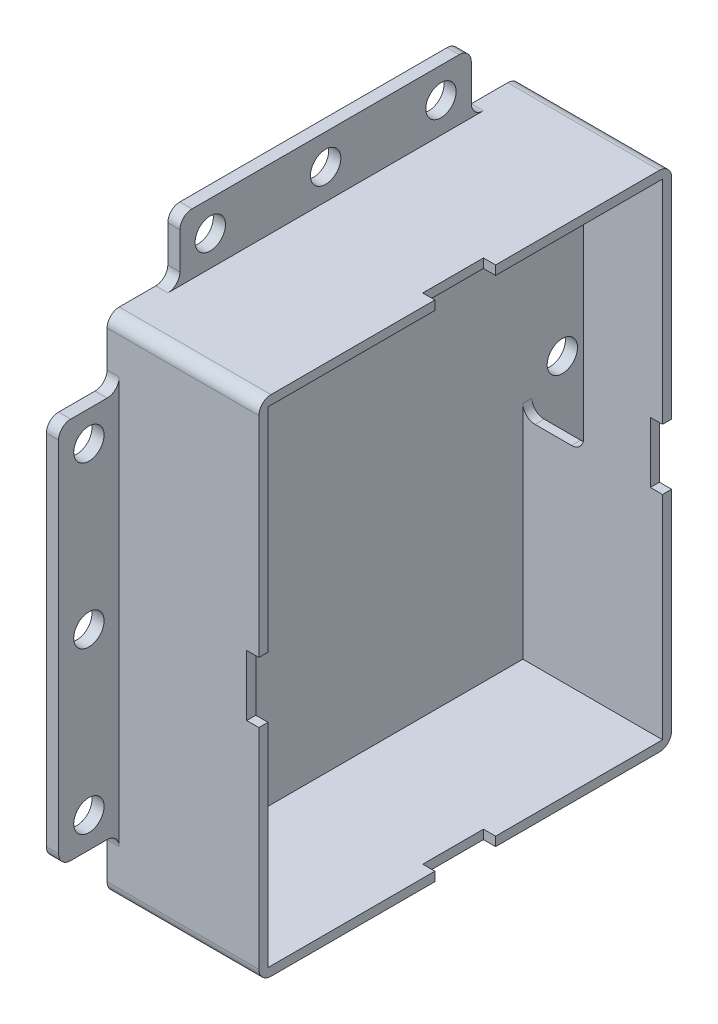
ISO-10303-21;
HEADER;
FILE_DESCRIPTION(('STEP AP214'),'2;1');
FILE_NAME('part.step','',(''),(''),'','','');
FILE_SCHEMA(('AUTOMOTIVE_DESIGN { 1 0 10303 214 1 1 1 1 }'));
ENDSEC;
DATA;
#1=APPLICATION_CONTEXT('core data for automotive mechanical design processes');
#2=APPLICATION_PROTOCOL_DEFINITION('international standard','automotive_design',2000,#1);
#3=PRODUCT_CONTEXT('',#1,'mechanical');
#4=PRODUCT('Part','Part','',(#3));
#5=PRODUCT_RELATED_PRODUCT_CATEGORY('part','',(#4));
#6=PRODUCT_DEFINITION_FORMATION('','',#4);
#7=PRODUCT_DEFINITION_CONTEXT('part definition',#1,'design');
#8=PRODUCT_DEFINITION('design','',#6,#7);
#9=PRODUCT_DEFINITION_SHAPE('','',#8);
#10=(LENGTH_UNIT() NAMED_UNIT(*) SI_UNIT(.MILLI.,.METRE.));
#11=(NAMED_UNIT(*) PLANE_ANGLE_UNIT() SI_UNIT($,.RADIAN.));
#12=(NAMED_UNIT(*) SI_UNIT($,.STERADIAN.) SOLID_ANGLE_UNIT());
#13=UNCERTAINTY_MEASURE_WITH_UNIT(LENGTH_MEASURE(1.E-05),#10,'distance_accuracy_value','');
#14=(GEOMETRIC_REPRESENTATION_CONTEXT(3) GLOBAL_UNCERTAINTY_ASSIGNED_CONTEXT((#13)) GLOBAL_UNIT_ASSIGNED_CONTEXT((#10,
#11,#12)) REPRESENTATION_CONTEXT('',''));
#15=CARTESIAN_POINT('',(0.,0.,0.));
#16=DIRECTION('',(0.,0.,1.));
#17=DIRECTION('',(1.,0.,0.));
#18=AXIS2_PLACEMENT_3D('',#15,#16,#17);
#19=CARTESIAN_POINT('',(25.,0.,0.));
#20=DIRECTION('',(1.,0.,0.));
#21=DIRECTION('',(0.,0.,-1.));
#22=AXIS2_PLACEMENT_3D('',#19,#20,#21);
#23=PLANE('',#22);
#24=DIRECTION('',(0.,0.,-1.));
#25=VECTOR('',#24,1.);
#26=CARTESIAN_POINT('',(25.,-1.5,-1.5));
#27=LINE('',#26,#25);
#28=CARTESIAN_POINT('',(25.,-1.5,27.5));
#29=VERTEX_POINT('',#28);
#30=CARTESIAN_POINT('',(25.,-1.5,0.5));
#31=VERTEX_POINT('',#30);
#32=EDGE_CURVE('E863',#29,#31,#27,.T.);
#33=ORIENTED_EDGE('',*,*,#32,.T.);
#34=CARTESIAN_POINT('',(25.,0.5,0.5));
#35=DIRECTION('',(1.,0.,0.));
#36=DIRECTION('',(0.,0.,-1.));
#37=AXIS2_PLACEMENT_3D('',#34,#35,#36);
#38=CIRCLE('',#37,2.);
#39=CARTESIAN_POINT('',(25.,0.5,-1.5));
#40=VERTEX_POINT('',#39);
#41=EDGE_CURVE('E1058',#31,#40,#38,.T.);
#42=ORIENTED_EDGE('',*,*,#41,.T.);
#43=DIRECTION('',(0.,1.,0.));
#44=VECTOR('',#43,1.);
#45=CARTESIAN_POINT('',(25.,-1.5,-1.5));
#46=LINE('',#45,#44);
#47=CARTESIAN_POINT('',(25.,35.,-1.5));
#48=VERTEX_POINT('',#47);
#49=EDGE_CURVE('E854',#40,#48,#46,.T.);
#50=ORIENTED_EDGE('',*,*,#49,.T.);
#51=DIRECTION('',(0.,0.,-1.));
#52=VECTOR('',#51,1.);
#53=CARTESIAN_POINT('',(25.,35.,0.));
#54=LINE('',#53,#52);
#55=CARTESIAN_POINT('',(25.,35.,0.));
#56=VERTEX_POINT('',#55);
#57=EDGE_CURVE('E543',#56,#48,#54,.T.);
#58=ORIENTED_EDGE('',*,*,#57,.F.);
#59=DIRECTION('',(0.,1.,0.));
#60=VECTOR('',#59,1.);
#61=CARTESIAN_POINT('',(25.,0.,0.));
#62=LINE('',#61,#60);
#63=CARTESIAN_POINT('',(25.,0.,0.));
#64=VERTEX_POINT('',#63);
#65=EDGE_CURVE('E830',#64,#56,#62,.T.);
#66=ORIENTED_EDGE('',*,*,#65,.F.);
#67=DIRECTION('',(0.,0.,-1.));
#68=VECTOR('',#67,1.);
#69=CARTESIAN_POINT('',(25.,0.,0.));
#70=LINE('',#69,#68);
#71=CARTESIAN_POINT('',(25.,0.,27.5));
#72=VERTEX_POINT('',#71);
#73=EDGE_CURVE('E825',#72,#64,#70,.T.);
#74=ORIENTED_EDGE('',*,*,#73,.F.);
#75=DIRECTION('',(0.,1.,0.));
#76=VECTOR('',#75,1.);
#77=CARTESIAN_POINT('',(25.,-1.5,27.5));
#78=LINE('',#77,#76);
#79=EDGE_CURVE('E568',#29,#72,#78,.T.);
#80=ORIENTED_EDGE('',*,*,#79,.F.);
#81=EDGE_LOOP('',(#33,#42,#50,#58,#66,#74,#80));
#82=FACE_BOUND('',#81,.T.);
#83=ADVANCED_FACE('F113',(#82),#23,.T.);
#84=DIRECTION('',(0.,-1.,0.));
#85=VECTOR('',#84,1.);
#86=CARTESIAN_POINT('',(25.,-1.5,66.5));
#87=LINE('',#86,#85);
#88=CARTESIAN_POINT('',(25.,35.,66.5));
#89=VERTEX_POINT('',#88);
#90=CARTESIAN_POINT('',(25.,0.5,66.5));
#91=VERTEX_POINT('',#90);
#92=EDGE_CURVE('E860',#89,#91,#87,.T.);
#93=ORIENTED_EDGE('',*,*,#92,.T.);
#94=CARTESIAN_POINT('',(25.,0.5,64.5));
#95=DIRECTION('',(1.,0.,0.));
#96=DIRECTION('',(0.,0.,-1.));
#97=AXIS2_PLACEMENT_3D('',#94,#95,#96);
#98=CIRCLE('',#97,2.);
#99=CARTESIAN_POINT('',(25.,-1.5,64.5));
#100=VERTEX_POINT('',#99);
#101=EDGE_CURVE('E967',#91,#100,#98,.T.);
#102=ORIENTED_EDGE('',*,*,#101,.T.);
#103=CARTESIAN_POINT('',(25.,-1.5,37.5));
#104=VERTEX_POINT('',#103);
#105=EDGE_CURVE('E864',#100,#104,#27,.T.);
#106=ORIENTED_EDGE('',*,*,#105,.T.);
#107=DIRECTION('',(0.,-1.,0.));
#108=VECTOR('',#107,1.);
#109=CARTESIAN_POINT('',(25.,-1.5,37.5));
#110=LINE('',#109,#108);
#111=CARTESIAN_POINT('',(25.,0.,37.5));
#112=VERTEX_POINT('',#111);
#113=EDGE_CURVE('E589',#112,#104,#110,.T.);
#114=ORIENTED_EDGE('',*,*,#113,.F.);
#115=CARTESIAN_POINT('',(25.,0.,65.));
#116=VERTEX_POINT('',#115);
#117=EDGE_CURVE('E826',#116,#112,#70,.T.);
#118=ORIENTED_EDGE('',*,*,#117,.F.);
#119=DIRECTION('',(0.,-1.,0.));
#120=VECTOR('',#119,1.);
#121=CARTESIAN_POINT('',(25.,0.,65.));
#122=LINE('',#121,#120);
#123=CARTESIAN_POINT('',(25.,35.,65.));
#124=VERTEX_POINT('',#123);
#125=EDGE_CURVE('E837',#124,#116,#122,.T.);
#126=ORIENTED_EDGE('',*,*,#125,.F.);
#127=DIRECTION('',(0.,0.,-1.));
#128=VECTOR('',#127,1.);
#129=CARTESIAN_POINT('',(25.,35.,66.5));
#130=LINE('',#129,#128);
#131=EDGE_CURVE('E588',#89,#124,#130,.T.);
#132=ORIENTED_EDGE('',*,*,#131,.F.);
#133=EDGE_LOOP('',(#93,#102,#106,#114,#118,#126,#132));
#134=FACE_BOUND('',#133,.T.);
#135=ADVANCED_FACE('F1308',(#134),#23,.T.);
#136=CARTESIAN_POINT('',(25.,45.,-1.5));
#137=VERTEX_POINT('',#136);
#138=CARTESIAN_POINT('',(25.,79.5,-1.5));
#139=VERTEX_POINT('',#138);
#140=EDGE_CURVE('E857',#137,#139,#46,.T.);
#141=ORIENTED_EDGE('',*,*,#140,.T.);
#142=CARTESIAN_POINT('',(25.,79.5,0.5));
#143=DIRECTION('',(1.,0.,0.));
#144=DIRECTION('',(0.,0.,-1.));
#145=AXIS2_PLACEMENT_3D('',#142,#143,#144);
#146=CIRCLE('',#145,2.);
#147=CARTESIAN_POINT('',(25.,81.5,0.5));
#148=VERTEX_POINT('',#147);
#149=EDGE_CURVE('E1009',#139,#148,#146,.T.);
#150=ORIENTED_EDGE('',*,*,#149,.T.);
#151=DIRECTION('',(0.,0.,1.));
#152=VECTOR('',#151,1.);
#153=CARTESIAN_POINT('',(25.,81.5,-1.5));
#154=LINE('',#153,#152);
#155=CARTESIAN_POINT('',(25.,81.5,27.5));
#156=VERTEX_POINT('',#155);
#157=EDGE_CURVE('E858',#148,#156,#154,.T.);
#158=ORIENTED_EDGE('',*,*,#157,.T.);
#159=DIRECTION('',(0.,1.,0.));
#160=VECTOR('',#159,1.);
#161=CARTESIAN_POINT('',(25.,80.,27.5));
#162=LINE('',#161,#160);
#163=CARTESIAN_POINT('',(25.,80.,27.5));
#164=VERTEX_POINT('',#163);
#165=EDGE_CURVE('E613',#164,#156,#162,.T.);
#166=ORIENTED_EDGE('',*,*,#165,.F.);
#167=DIRECTION('',(0.,0.,1.));
#168=VECTOR('',#167,1.);
#169=CARTESIAN_POINT('',(25.,80.,0.));
#170=LINE('',#169,#168);
#171=CARTESIAN_POINT('',(25.,80.,0.));
#172=VERTEX_POINT('',#171);
#173=EDGE_CURVE('E834',#172,#164,#170,.T.);
#174=ORIENTED_EDGE('',*,*,#173,.F.);
#175=CARTESIAN_POINT('',(25.,45.,0.));
#176=VERTEX_POINT('',#175);
#177=EDGE_CURVE('E829',#176,#172,#62,.T.);
#178=ORIENTED_EDGE('',*,*,#177,.F.);
#179=DIRECTION('',(0.,0.,1.));
#180=VECTOR('',#179,1.);
#181=CARTESIAN_POINT('',(25.,45.,0.));
#182=LINE('',#181,#180);
#183=EDGE_CURVE('E558',#137,#176,#182,.T.);
#184=ORIENTED_EDGE('',*,*,#183,.F.);
#185=EDGE_LOOP('',(#141,#150,#158,#166,#174,#178,#184));
#186=FACE_BOUND('',#185,.T.);
#187=ADVANCED_FACE('F1126',(#186),#23,.T.);
#188=CARTESIAN_POINT('',(25.,-1.5,-1.5));
#189=DIRECTION('',(0.,0.,1.));
#190=DIRECTION('',(1.,0.,0.));
#191=AXIS2_PLACEMENT_3D('',#188,#189,#190);
#192=PLANE('',#191);
#193=DIRECTION('',(0.,-1.,0.));
#194=VECTOR('',#193,1.);
#195=CARTESIAN_POINT('',(2.,-1.5,-1.5));
#196=LINE('',#195,#194);
#197=CARTESIAN_POINT('',(2.,73.5,-1.5));
#198=VERTEX_POINT('',#197);
#199=CARTESIAN_POINT('',(2.,69.5,-1.5));
#200=VERTEX_POINT('',#199);
#201=EDGE_CURVE('E1032',#198,#200,#196,.T.);
#202=ORIENTED_EDGE('',*,*,#201,.F.);
#203=DIRECTION('',(-1.,0.,0.));
#204=VECTOR('',#203,1.);
#205=CARTESIAN_POINT('',(25.,73.5,-1.5));
#206=LINE('',#205,#204);
#207=CARTESIAN_POINT('',(0.,73.5,-1.5));
#208=VERTEX_POINT('',#207);
#209=EDGE_CURVE('E1108',#198,#208,#206,.T.);
#210=ORIENTED_EDGE('',*,*,#209,.T.);
#211=DIRECTION('',(0.,1.,0.));
#212=VECTOR('',#211,1.);
#213=CARTESIAN_POINT('',(0.,-1.5,-1.5));
#214=LINE('',#213,#212);
#215=CARTESIAN_POINT('',(0.,79.5,-1.5));
#216=VERTEX_POINT('',#215);
#217=EDGE_CURVE('E853',#208,#216,#214,.T.);
#218=ORIENTED_EDGE('',*,*,#217,.T.);
#219=DIRECTION('',(-1.,0.,0.));
#220=VECTOR('',#219,1.);
#221=CARTESIAN_POINT('',(25.,79.5,-1.5));
#222=LINE('',#221,#220);
#223=EDGE_CURVE('E1007',#216,#139,#222,.F.);
#224=ORIENTED_EDGE('',*,*,#223,.T.);
#225=ORIENTED_EDGE('',*,*,#140,.F.);
#226=DIRECTION('',(1.,0.,0.));
#227=VECTOR('',#226,1.);
#228=CARTESIAN_POINT('',(23.,45.,-1.5));
#229=LINE('',#228,#227);
#230=CARTESIAN_POINT('',(23.,45.,-1.5));
#231=VERTEX_POINT('',#230);
#232=EDGE_CURVE('E547',#231,#137,#229,.T.);
#233=ORIENTED_EDGE('',*,*,#232,.F.);
#234=DIRECTION('',(0.,1.,0.));
#235=VECTOR('',#234,1.);
#236=CARTESIAN_POINT('',(23.,35.,-1.5));
#237=LINE('',#236,#235);
#238=CARTESIAN_POINT('',(23.,35.,-1.5));
#239=VERTEX_POINT('',#238);
#240=EDGE_CURVE('E554',#239,#231,#237,.T.);
#241=ORIENTED_EDGE('',*,*,#240,.F.);
#242=DIRECTION('',(1.,0.,0.));
#243=VECTOR('',#242,1.);
#244=CARTESIAN_POINT('',(23.,35.,-1.5));
#245=LINE('',#244,#243);
#246=EDGE_CURVE('E537',#239,#48,#245,.T.);
#247=ORIENTED_EDGE('',*,*,#246,.T.);
#248=ORIENTED_EDGE('',*,*,#49,.F.);
#249=DIRECTION('',(-1.,0.,0.));
#250=VECTOR('',#249,1.);
#251=CARTESIAN_POINT('',(25.,0.5,-1.5));
#252=LINE('',#251,#250);
#253=CARTESIAN_POINT('',(0.,0.5,-1.5));
#254=VERTEX_POINT('',#253);
#255=EDGE_CURVE('E1001',#40,#254,#252,.T.);
#256=ORIENTED_EDGE('',*,*,#255,.T.);
#257=CARTESIAN_POINT('',(0.,6.5,-1.5));
#258=VERTEX_POINT('',#257);
#259=EDGE_CURVE('E867',#254,#258,#214,.T.);
#260=ORIENTED_EDGE('',*,*,#259,.T.);
#261=DIRECTION('',(-1.,0.,0.));
#262=VECTOR('',#261,1.);
#263=CARTESIAN_POINT('',(2.,6.5,-1.5));
#264=LINE('',#263,#262);
#265=CARTESIAN_POINT('',(2.,6.5,-1.5));
#266=VERTEX_POINT('',#265);
#267=EDGE_CURVE('E1004',#258,#266,#264,.F.);
#268=ORIENTED_EDGE('',*,*,#267,.T.);
#269=DIRECTION('',(0.,-1.,0.));
#270=VECTOR('',#269,1.);
#271=CARTESIAN_POINT('',(2.,-1.5,-1.5));
#272=LINE('',#271,#270);
#273=CARTESIAN_POINT('',(2.,36.5,-1.5));
#274=VERTEX_POINT('',#273);
#275=EDGE_CURVE('E823',#274,#266,#272,.T.);
#276=ORIENTED_EDGE('',*,*,#275,.F.);
#277=CARTESIAN_POINT('',(4.,36.5,-1.5));
#278=DIRECTION('',(0.,0.,1.));
#279=DIRECTION('',(1.,0.,0.));
#280=AXIS2_PLACEMENT_3D('',#277,#278,#279);
#281=CIRCLE('',#280,2.);
#282=CARTESIAN_POINT('',(4.,34.5,-1.5));
#283=VERTEX_POINT('',#282);
#284=EDGE_CURVE('E1099',#274,#283,#281,.T.);
#285=ORIENTED_EDGE('',*,*,#284,.T.);
#286=DIRECTION('',(-1.,0.,0.));
#287=VECTOR('',#286,1.);
#288=CARTESIAN_POINT('',(2.,34.5,-1.5));
#289=LINE('',#288,#287);
#290=CARTESIAN_POINT('',(10.,34.5,-1.5));
#291=VERTEX_POINT('',#290);
#292=EDGE_CURVE('E657',#291,#283,#289,.T.);
#293=ORIENTED_EDGE('',*,*,#292,.F.);
#294=CARTESIAN_POINT('',(10.,36.5,-1.5));
#295=DIRECTION('',(0.,0.,1.));
#296=DIRECTION('',(1.,0.,0.));
#297=AXIS2_PLACEMENT_3D('',#294,#295,#296);
#298=CIRCLE('',#297,2.);
#299=CARTESIAN_POINT('',(12.,36.5,-1.5));
#300=VERTEX_POINT('',#299);
#301=EDGE_CURVE('E1091',#291,#300,#298,.T.);
#302=ORIENTED_EDGE('',*,*,#301,.T.);
#303=DIRECTION('',(0.,-1.,0.));
#304=VECTOR('',#303,1.);
#305=CARTESIAN_POINT('',(12.,71.5,-1.5));
#306=LINE('',#305,#304);
#307=CARTESIAN_POINT('',(12.,69.5,-1.5));
#308=VERTEX_POINT('',#307);
#309=EDGE_CURVE('E654',#308,#300,#306,.T.);
#310=ORIENTED_EDGE('',*,*,#309,.F.);
#311=CARTESIAN_POINT('',(10.,69.5,-1.5));
#312=DIRECTION('',(0.,0.,1.));
#313=DIRECTION('',(1.,0.,0.));
#314=AXIS2_PLACEMENT_3D('',#311,#312,#313);
#315=CIRCLE('',#314,2.);
#316=CARTESIAN_POINT('',(10.,71.5,-1.5));
#317=VERTEX_POINT('',#316);
#318=EDGE_CURVE('E1087',#308,#317,#315,.T.);
#319=ORIENTED_EDGE('',*,*,#318,.T.);
#320=DIRECTION('',(1.,0.,0.));
#321=VECTOR('',#320,1.);
#322=CARTESIAN_POINT('',(2.,71.5,-1.5));
#323=LINE('',#322,#321);
#324=CARTESIAN_POINT('',(4.,71.5,-1.5));
#325=VERTEX_POINT('',#324);
#326=EDGE_CURVE('E572',#325,#317,#323,.T.);
#327=ORIENTED_EDGE('',*,*,#326,.F.);
#328=CARTESIAN_POINT('',(4.,69.5,-1.5));
#329=DIRECTION('',(0.,0.,1.));
#330=DIRECTION('',(1.,0.,0.));
#331=AXIS2_PLACEMENT_3D('',#328,#329,#330);
#332=CIRCLE('',#331,2.);
#333=EDGE_CURVE('E1095',#325,#200,#332,.T.);
#334=ORIENTED_EDGE('',*,*,#333,.T.);
#335=EDGE_LOOP('',(#202,#210,#218,#224,#225,#233,#241,#247,#248,#256,#260,#268,#276,#285,#293,
#302,#310,#319,#327,#334));
#336=FACE_BOUND('',#335,.T.);
#337=ADVANCED_FACE('F560',(#336),#192,.F.);
#338=CARTESIAN_POINT('',(25.,0.,0.));
#339=DIRECTION('',(0.,1.,0.));
#340=DIRECTION('',(0.,0.,1.));
#341=AXIS2_PLACEMENT_3D('',#338,#339,#340);
#342=PLANE('',#341);
#343=DIRECTION('',(1.,0.,0.));
#344=VECTOR('',#343,1.);
#345=CARTESIAN_POINT('',(23.,0.,37.5));
#346=LINE('',#345,#344);
#347=CARTESIAN_POINT('',(23.,0.,37.5));
#348=VERTEX_POINT('',#347);
#349=EDGE_CURVE('E583',#348,#112,#346,.T.);
#350=ORIENTED_EDGE('',*,*,#349,.F.);
#351=DIRECTION('',(0.,0.,1.));
#352=VECTOR('',#351,1.);
#353=CARTESIAN_POINT('',(23.,0.,37.5));
#354=LINE('',#353,#352);
#355=CARTESIAN_POINT('',(23.,0.,27.5));
#356=VERTEX_POINT('',#355);
#357=EDGE_CURVE('E595',#356,#348,#354,.T.);
#358=ORIENTED_EDGE('',*,*,#357,.F.);
#359=DIRECTION('',(1.,0.,0.));
#360=VECTOR('',#359,1.);
#361=CARTESIAN_POINT('',(23.,0.,27.5));
#362=LINE('',#361,#360);
#363=EDGE_CURVE('E580',#356,#72,#362,.T.);
#364=ORIENTED_EDGE('',*,*,#363,.T.);
#365=ORIENTED_EDGE('',*,*,#73,.T.);
#366=DIRECTION('',(-1.,0.,0.));
#367=VECTOR('',#366,1.);
#368=CARTESIAN_POINT('',(25.,0.,0.));
#369=LINE('',#368,#367);
#370=CARTESIAN_POINT('',(2.,0.,0.));
#371=VERTEX_POINT('',#370);
#372=EDGE_CURVE('E850',#64,#371,#369,.T.);
#373=ORIENTED_EDGE('',*,*,#372,.T.);
#374=DIRECTION('',(0.,0.,1.));
#375=VECTOR('',#374,1.);
#376=CARTESIAN_POINT('',(2.,0.,0.));
#377=LINE('',#376,#375);
#378=CARTESIAN_POINT('',(2.,0.,65.));
#379=VERTEX_POINT('',#378);
#380=EDGE_CURVE('E814',#371,#379,#377,.T.);
#381=ORIENTED_EDGE('',*,*,#380,.T.);
#382=DIRECTION('',(-1.,0.,0.));
#383=VECTOR('',#382,1.);
#384=CARTESIAN_POINT('',(25.,0.,65.));
#385=LINE('',#384,#383);
#386=EDGE_CURVE('E841',#116,#379,#385,.T.);
#387=ORIENTED_EDGE('',*,*,#386,.F.);
#388=ORIENTED_EDGE('',*,*,#117,.T.);
#389=EDGE_LOOP('',(#350,#358,#364,#365,#373,#381,#387,#388));
#390=FACE_BOUND('',#389,.T.);
#391=ADVANCED_FACE('F1331',(#390),#342,.T.);
#392=CARTESIAN_POINT('',(25.,0.,0.));
#393=DIRECTION('',(0.,0.,1.));
#394=DIRECTION('',(1.,0.,0.));
#395=AXIS2_PLACEMENT_3D('',#392,#393,#394);
#396=PLANE('',#395);
#397=DIRECTION('',(1.,0.,0.));
#398=VECTOR('',#397,1.);
#399=CARTESIAN_POINT('',(23.,35.,0.));
#400=LINE('',#399,#398);
#401=CARTESIAN_POINT('',(23.,35.,0.));
#402=VERTEX_POINT('',#401);
#403=EDGE_CURVE('E570',#402,#56,#400,.T.);
#404=ORIENTED_EDGE('',*,*,#403,.F.);
#405=DIRECTION('',(0.,-1.,0.));
#406=VECTOR('',#405,1.);
#407=CARTESIAN_POINT('',(23.,35.,0.));
#408=LINE('',#407,#406);
#409=CARTESIAN_POINT('',(23.,45.,0.));
#410=VERTEX_POINT('',#409);
#411=EDGE_CURVE('E548',#410,#402,#408,.T.);
#412=ORIENTED_EDGE('',*,*,#411,.F.);
#413=DIRECTION('',(1.,0.,0.));
#414=VECTOR('',#413,1.);
#415=CARTESIAN_POINT('',(23.,45.,0.));
#416=LINE('',#415,#414);
#417=EDGE_CURVE('E573',#410,#176,#416,.T.);
#418=ORIENTED_EDGE('',*,*,#417,.T.);
#419=ORIENTED_EDGE('',*,*,#177,.T.);
#420=DIRECTION('',(-1.,0.,0.));
#421=VECTOR('',#420,1.);
#422=CARTESIAN_POINT('',(25.,80.,0.));
#423=LINE('',#422,#421);
#424=CARTESIAN_POINT('',(2.,80.,0.));
#425=VERTEX_POINT('',#424);
#426=EDGE_CURVE('E847',#172,#425,#423,.T.);
#427=ORIENTED_EDGE('',*,*,#426,.T.);
#428=DIRECTION('',(0.,-1.,0.));
#429=VECTOR('',#428,1.);
#430=CARTESIAN_POINT('',(2.,0.,0.));
#431=LINE('',#430,#429);
#432=CARTESIAN_POINT('',(2.,69.5,0.));
#433=VERTEX_POINT('',#432);
#434=EDGE_CURVE('E812',#425,#433,#431,.T.);
#435=ORIENTED_EDGE('',*,*,#434,.T.);
#436=CARTESIAN_POINT('',(4.,69.5,0.));
#437=DIRECTION('',(0.,0.,1.));
#438=DIRECTION('',(1.,0.,0.));
#439=AXIS2_PLACEMENT_3D('',#436,#437,#438);
#440=CIRCLE('',#439,2.);
#441=CARTESIAN_POINT('',(4.,71.5,0.));
#442=VERTEX_POINT('',#441);
#443=EDGE_CURVE('E1097',#433,#442,#440,.F.);
#444=ORIENTED_EDGE('',*,*,#443,.T.);
#445=DIRECTION('',(-1.,0.,0.));
#446=VECTOR('',#445,1.);
#447=CARTESIAN_POINT('',(25.,71.5,0.));
#448=LINE('',#447,#446);
#449=CARTESIAN_POINT('',(10.,71.5,0.));
#450=VERTEX_POINT('',#449);
#451=EDGE_CURVE('E660',#450,#442,#448,.T.);
#452=ORIENTED_EDGE('',*,*,#451,.F.);
#453=CARTESIAN_POINT('',(10.,69.5,0.));
#454=DIRECTION('',(0.,0.,1.));
#455=DIRECTION('',(1.,0.,0.));
#456=AXIS2_PLACEMENT_3D('',#453,#454,#455);
#457=CIRCLE('',#456,2.);
#458=CARTESIAN_POINT('',(12.,69.5,0.));
#459=VERTEX_POINT('',#458);
#460=EDGE_CURVE('E1089',#450,#459,#457,.F.);
#461=ORIENTED_EDGE('',*,*,#460,.T.);
#462=DIRECTION('',(0.,1.,0.));
#463=VECTOR('',#462,1.);
#464=CARTESIAN_POINT('',(12.,0.,0.));
#465=LINE('',#464,#463);
#466=CARTESIAN_POINT('',(12.,36.5,0.));
#467=VERTEX_POINT('',#466);
#468=EDGE_CURVE('E884',#467,#459,#465,.T.);
#469=ORIENTED_EDGE('',*,*,#468,.F.);
#470=CARTESIAN_POINT('',(10.,36.5,0.));
#471=DIRECTION('',(0.,0.,1.));
#472=DIRECTION('',(1.,0.,0.));
#473=AXIS2_PLACEMENT_3D('',#470,#471,#472);
#474=CIRCLE('',#473,2.);
#475=CARTESIAN_POINT('',(10.,34.5,0.));
#476=VERTEX_POINT('',#475);
#477=EDGE_CURVE('E1093',#467,#476,#474,.F.);
#478=ORIENTED_EDGE('',*,*,#477,.T.);
#479=DIRECTION('',(1.,0.,0.));
#480=VECTOR('',#479,1.);
#481=CARTESIAN_POINT('',(25.,34.5,0.));
#482=LINE('',#481,#480);
#483=CARTESIAN_POINT('',(4.,34.5,0.));
#484=VERTEX_POINT('',#483);
#485=EDGE_CURVE('E663',#484,#476,#482,.T.);
#486=ORIENTED_EDGE('',*,*,#485,.F.);
#487=CARTESIAN_POINT('',(4.,36.5,0.));
#488=DIRECTION('',(0.,0.,1.));
#489=DIRECTION('',(1.,0.,0.));
#490=AXIS2_PLACEMENT_3D('',#487,#488,#489);
#491=CIRCLE('',#490,2.);
#492=CARTESIAN_POINT('',(2.,36.5,0.));
#493=VERTEX_POINT('',#492);
#494=EDGE_CURVE('E1101',#484,#493,#491,.F.);
#495=ORIENTED_EDGE('',*,*,#494,.T.);
#496=EDGE_CURVE('E811',#493,#371,#431,.T.);
#497=ORIENTED_EDGE('',*,*,#496,.T.);
#498=ORIENTED_EDGE('',*,*,#372,.F.);
#499=ORIENTED_EDGE('',*,*,#65,.T.);
#500=EDGE_LOOP('',(#404,#412,#418,#419,#427,#435,#444,#452,#461,#469,#478,#486,#495,#497,#498,#499));
#501=FACE_BOUND('',#500,.T.);
#502=ADVANCED_FACE('F1295',(#501),#396,.T.);
#503=CARTESIAN_POINT('',(25.,80.,0.));
#504=DIRECTION('',(0.,-1.,0.));
#505=DIRECTION('',(0.,0.,-1.));
#506=AXIS2_PLACEMENT_3D('',#503,#504,#505);
#507=PLANE('',#506);
#508=DIRECTION('',(1.,0.,0.));
#509=VECTOR('',#508,1.);
#510=CARTESIAN_POINT('',(23.,80.,37.5));
#511=LINE('',#510,#509);
#512=CARTESIAN_POINT('',(23.,80.,37.5));
#513=VERTEX_POINT('',#512);
#514=CARTESIAN_POINT('',(25.,80.,37.5));
#515=VERTEX_POINT('',#514);
#516=EDGE_CURVE('E636',#513,#515,#511,.T.);
#517=ORIENTED_EDGE('',*,*,#516,.T.);
#518=CARTESIAN_POINT('',(25.,80.,65.));
#519=VERTEX_POINT('',#518);
#520=EDGE_CURVE('E833',#515,#519,#170,.T.);
#521=ORIENTED_EDGE('',*,*,#520,.T.);
#522=DIRECTION('',(-1.,0.,0.));
#523=VECTOR('',#522,1.);
#524=CARTESIAN_POINT('',(25.,80.,65.));
#525=LINE('',#524,#523);
#526=CARTESIAN_POINT('',(2.,80.,65.));
#527=VERTEX_POINT('',#526);
#528=EDGE_CURVE('E844',#519,#527,#525,.T.);
#529=ORIENTED_EDGE('',*,*,#528,.T.);
#530=DIRECTION('',(0.,0.,-1.));
#531=VECTOR('',#530,1.);
#532=CARTESIAN_POINT('',(2.,80.,0.));
#533=LINE('',#532,#531);
#534=EDGE_CURVE('E686',#527,#425,#533,.T.);
#535=ORIENTED_EDGE('',*,*,#534,.T.);
#536=ORIENTED_EDGE('',*,*,#426,.F.);
#537=ORIENTED_EDGE('',*,*,#173,.T.);
#538=DIRECTION('',(1.,0.,0.));
#539=VECTOR('',#538,1.);
#540=CARTESIAN_POINT('',(23.,80.,27.5));
#541=LINE('',#540,#539);
#542=CARTESIAN_POINT('',(23.,80.,27.5));
#543=VERTEX_POINT('',#542);
#544=EDGE_CURVE('E628',#543,#164,#541,.T.);
#545=ORIENTED_EDGE('',*,*,#544,.F.);
#546=DIRECTION('',(0.,0.,-1.));
#547=VECTOR('',#546,1.);
#548=CARTESIAN_POINT('',(23.,80.,37.5));
#549=LINE('',#548,#547);
#550=EDGE_CURVE('E641',#513,#543,#549,.T.);
#551=ORIENTED_EDGE('',*,*,#550,.F.);
#552=EDGE_LOOP('',(#517,#521,#529,#535,#536,#537,#545,#551));
#553=FACE_BOUND('',#552,.T.);
#554=ADVANCED_FACE('F1292',(#553),#507,.T.);
#555=CARTESIAN_POINT('',(25.,0.,65.));
#556=DIRECTION('',(0.,0.,-1.));
#557=DIRECTION('',(-1.,0.,0.));
#558=AXIS2_PLACEMENT_3D('',#555,#556,#557);
#559=PLANE('',#558);
#560=DIRECTION('',(1.,0.,0.));
#561=VECTOR('',#560,1.);
#562=CARTESIAN_POINT('',(23.,35.,65.));
#563=LINE('',#562,#561);
#564=CARTESIAN_POINT('',(23.,35.,65.));
#565=VERTEX_POINT('',#564);
#566=EDGE_CURVE('E602',#565,#124,#563,.T.);
#567=ORIENTED_EDGE('',*,*,#566,.T.);
#568=ORIENTED_EDGE('',*,*,#125,.T.);
#569=ORIENTED_EDGE('',*,*,#386,.T.);
#570=DIRECTION('',(0.,1.,0.));
#571=VECTOR('',#570,1.);
#572=CARTESIAN_POINT('',(2.,0.,65.));
#573=LINE('',#572,#571);
#574=EDGE_CURVE('E866',#379,#527,#573,.T.);
#575=ORIENTED_EDGE('',*,*,#574,.T.);
#576=ORIENTED_EDGE('',*,*,#528,.F.);
#577=CARTESIAN_POINT('',(25.,45.,65.));
#578=VERTEX_POINT('',#577);
#579=EDGE_CURVE('E838',#519,#578,#122,.T.);
#580=ORIENTED_EDGE('',*,*,#579,.T.);
#581=DIRECTION('',(1.,0.,0.));
#582=VECTOR('',#581,1.);
#583=CARTESIAN_POINT('',(23.,45.,65.));
#584=LINE('',#583,#582);
#585=CARTESIAN_POINT('',(23.,45.,65.));
#586=VERTEX_POINT('',#585);
#587=EDGE_CURVE('E606',#586,#578,#584,.T.);
#588=ORIENTED_EDGE('',*,*,#587,.F.);
#589=DIRECTION('',(0.,1.,0.));
#590=VECTOR('',#589,1.);
#591=CARTESIAN_POINT('',(23.,35.,65.));
#592=LINE('',#591,#590);
#593=EDGE_CURVE('E623',#565,#586,#592,.T.);
#594=ORIENTED_EDGE('',*,*,#593,.F.);
#595=EDGE_LOOP('',(#567,#568,#569,#575,#576,#580,#588,#594));
#596=FACE_BOUND('',#595,.T.);
#597=ADVANCED_FACE('F1317',(#596),#559,.T.);
#598=CARTESIAN_POINT('',(25.,81.5,37.5));
#599=VERTEX_POINT('',#598);
#600=CARTESIAN_POINT('',(25.,81.5,64.5));
#601=VERTEX_POINT('',#600);
#602=EDGE_CURVE('E856',#599,#601,#154,.T.);
#603=ORIENTED_EDGE('',*,*,#602,.T.);
#604=CARTESIAN_POINT('',(25.,79.5,64.5));
#605=DIRECTION('',(1.,0.,0.));
#606=DIRECTION('',(0.,0.,-1.));
#607=AXIS2_PLACEMENT_3D('',#604,#605,#606);
#608=CIRCLE('',#607,2.);
#609=CARTESIAN_POINT('',(25.,79.5,66.5));
#610=VERTEX_POINT('',#609);
#611=EDGE_CURVE('E999',#601,#610,#608,.T.);
#612=ORIENTED_EDGE('',*,*,#611,.T.);
#613=CARTESIAN_POINT('',(25.,45.,66.5));
#614=VERTEX_POINT('',#613);
#615=EDGE_CURVE('E861',#610,#614,#87,.T.);
#616=ORIENTED_EDGE('',*,*,#615,.T.);
#617=DIRECTION('',(0.,0.,1.));
#618=VECTOR('',#617,1.);
#619=CARTESIAN_POINT('',(25.,45.,66.5));
#620=LINE('',#619,#618);
#621=EDGE_CURVE('E614',#578,#614,#620,.T.);
#622=ORIENTED_EDGE('',*,*,#621,.F.);
#623=ORIENTED_EDGE('',*,*,#579,.F.);
#624=ORIENTED_EDGE('',*,*,#520,.F.);
#625=DIRECTION('',(0.,-1.,0.));
#626=VECTOR('',#625,1.);
#627=CARTESIAN_POINT('',(25.,80.,37.5));
#628=LINE('',#627,#626);
#629=EDGE_CURVE('E639',#599,#515,#628,.T.);
#630=ORIENTED_EDGE('',*,*,#629,.F.);
#631=EDGE_LOOP('',(#603,#612,#616,#622,#623,#624,#630));
#632=FACE_BOUND('',#631,.T.);
#633=ADVANCED_FACE('F1310',(#632),#23,.T.);
#634=CARTESIAN_POINT('',(0.,0.,0.));
#635=DIRECTION('',(1.,0.,0.));
#636=DIRECTION('',(0.,0.,-1.));
#637=AXIS2_PLACEMENT_3D('',#634,#635,#636);
#638=PLANE('',#637);
#639=DIRECTION('',(0.,0.,-1.));
#640=VECTOR('',#639,1.);
#641=CARTESIAN_POINT('',(0.,-11.5,0.));
#642=LINE('',#641,#640);
#643=CARTESIAN_POINT('',(0.,-11.5,54.5));
#644=VERTEX_POINT('',#643);
#645=CARTESIAN_POINT('',(0.,-11.5,10.5));
#646=VERTEX_POINT('',#645);
#647=EDGE_CURVE('E769',#644,#646,#642,.T.);
#648=ORIENTED_EDGE('',*,*,#647,.F.);
#649=CARTESIAN_POINT('',(0.,-9.49999999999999,54.5));
#650=DIRECTION('',(1.,0.,0.));
#651=DIRECTION('',(0.,0.,-1.));
#652=AXIS2_PLACEMENT_3D('',#649,#650,#651);
#653=CIRCLE('',#652,2.);
#654=CARTESIAN_POINT('',(0.,-9.49999999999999,56.5));
#655=VERTEX_POINT('',#654);
#656=EDGE_CURVE('E931',#644,#655,#653,.F.);
#657=ORIENTED_EDGE('',*,*,#656,.T.);
#658=DIRECTION('',(0.,-1.,0.));
#659=VECTOR('',#658,1.);
#660=CARTESIAN_POINT('',(0.,0.,56.5));
#661=LINE('',#660,#659);
#662=CARTESIAN_POINT('',(0.,-3.5,56.5));
#663=VERTEX_POINT('',#662);
#664=EDGE_CURVE('E772',#663,#655,#661,.T.);
#665=ORIENTED_EDGE('',*,*,#664,.F.);
#666=CARTESIAN_POINT('',(0.,-3.5,58.5));
#667=DIRECTION('',(1.,0.,0.));
#668=DIRECTION('',(0.,0.,-1.));
#669=AXIS2_PLACEMENT_3D('',#666,#667,#668);
#670=CIRCLE('',#669,2.);
#671=CARTESIAN_POINT('',(0.,-1.5,58.5));
#672=VERTEX_POINT('',#671);
#673=EDGE_CURVE('E1065',#663,#672,#670,.T.);
#674=ORIENTED_EDGE('',*,*,#673,.T.);
#675=DIRECTION('',(0.,0.,-1.));
#676=VECTOR('',#675,1.);
#677=CARTESIAN_POINT('',(0.,-1.5,-1.5));
#678=LINE('',#677,#676);
#679=CARTESIAN_POINT('',(0.,-1.5,64.5));
#680=VERTEX_POINT('',#679);
#681=EDGE_CURVE('E881',#680,#672,#678,.T.);
#682=ORIENTED_EDGE('',*,*,#681,.F.);
#683=CARTESIAN_POINT('',(0.,0.5,64.5));
#684=DIRECTION('',(1.,0.,0.));
#685=DIRECTION('',(0.,0.,-1.));
#686=AXIS2_PLACEMENT_3D('',#683,#684,#685);
#687=CIRCLE('',#686,2.);
#688=CARTESIAN_POINT('',(0.,0.5,66.5));
#689=VERTEX_POINT('',#688);
#690=EDGE_CURVE('E927',#680,#689,#687,.F.);
#691=ORIENTED_EDGE('',*,*,#690,.T.);
#692=DIRECTION('',(0.,-1.,0.));
#693=VECTOR('',#692,1.);
#694=CARTESIAN_POINT('',(0.,-1.5,66.5));
#695=LINE('',#694,#693);
#696=CARTESIAN_POINT('',(0.,6.50000000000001,66.5));
#697=VERTEX_POINT('',#696);
#698=EDGE_CURVE('E874',#697,#689,#695,.T.);
#699=ORIENTED_EDGE('',*,*,#698,.F.);
#700=CARTESIAN_POINT('',(0.,6.50000000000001,68.5));
#701=DIRECTION('',(1.,0.,0.));
#702=DIRECTION('',(0.,0.,-1.));
#703=AXIS2_PLACEMENT_3D('',#700,#701,#702);
#704=CIRCLE('',#703,2.);
#705=CARTESIAN_POINT('',(0.,8.50000000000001,68.5));
#706=VERTEX_POINT('',#705);
#707=EDGE_CURVE('E1069',#697,#706,#704,.T.);
#708=ORIENTED_EDGE('',*,*,#707,.T.);
#709=DIRECTION('',(0.,0.,1.));
#710=VECTOR('',#709,1.);
#711=CARTESIAN_POINT('',(0.,8.50000000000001,0.));
#712=LINE('',#711,#710);
#713=CARTESIAN_POINT('',(0.,8.50000000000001,74.5));
#714=VERTEX_POINT('',#713);
#715=EDGE_CURVE('E733',#706,#714,#712,.T.);
#716=ORIENTED_EDGE('',*,*,#715,.T.);
#717=CARTESIAN_POINT('',(0.,10.5,74.5));
#718=DIRECTION('',(1.,0.,0.));
#719=DIRECTION('',(0.,0.,-1.));
#720=AXIS2_PLACEMENT_3D('',#717,#718,#719);
#721=CIRCLE('',#720,2.);
#722=CARTESIAN_POINT('',(0.,10.5,76.5));
#723=VERTEX_POINT('',#722);
#724=EDGE_CURVE('E929',#714,#723,#721,.F.);
#725=ORIENTED_EDGE('',*,*,#724,.T.);
#726=DIRECTION('',(0.,-1.,0.));
#727=VECTOR('',#726,1.);
#728=CARTESIAN_POINT('',(0.,0.,76.5));
#729=LINE('',#728,#727);
#730=CARTESIAN_POINT('',(0.,69.5,76.5));
#731=VERTEX_POINT('',#730);
#732=EDGE_CURVE('E736',#731,#723,#729,.T.);
#733=ORIENTED_EDGE('',*,*,#732,.F.);
#734=CARTESIAN_POINT('',(0.,69.5,74.5));
#735=DIRECTION('',(1.,0.,0.));
#736=DIRECTION('',(0.,0.,-1.));
#737=AXIS2_PLACEMENT_3D('',#734,#735,#736);
#738=CIRCLE('',#737,2.);
#739=CARTESIAN_POINT('',(0.,71.5,74.5));
#740=VERTEX_POINT('',#739);
#741=EDGE_CURVE('E925',#731,#740,#738,.F.);
#742=ORIENTED_EDGE('',*,*,#741,.T.);
#743=DIRECTION('',(0.,0.,1.));
#744=VECTOR('',#743,1.);
#745=CARTESIAN_POINT('',(0.,71.5,0.));
#746=LINE('',#745,#744);
#747=CARTESIAN_POINT('',(0.,71.5,68.5));
#748=VERTEX_POINT('',#747);
#749=EDGE_CURVE('E709',#748,#740,#746,.T.);
#750=ORIENTED_EDGE('',*,*,#749,.F.);
#751=CARTESIAN_POINT('',(0.,73.5,68.5));
#752=DIRECTION('',(1.,0.,0.));
#753=DIRECTION('',(0.,0.,-1.));
#754=AXIS2_PLACEMENT_3D('',#751,#752,#753);
#755=CIRCLE('',#754,2.);
#756=CARTESIAN_POINT('',(0.,73.5,66.5));
#757=VERTEX_POINT('',#756);
#758=EDGE_CURVE('E1074',#748,#757,#755,.T.);
#759=ORIENTED_EDGE('',*,*,#758,.T.);
#760=CARTESIAN_POINT('',(0.,79.5,66.5));
#761=VERTEX_POINT('',#760);
#762=EDGE_CURVE('E875',#761,#757,#695,.T.);
#763=ORIENTED_EDGE('',*,*,#762,.F.);
#764=CARTESIAN_POINT('',(0.,79.5,64.5));
#765=DIRECTION('',(1.,0.,0.));
#766=DIRECTION('',(0.,0.,-1.));
#767=AXIS2_PLACEMENT_3D('',#764,#765,#766);
#768=CIRCLE('',#767,2.);
#769=CARTESIAN_POINT('',(0.,81.5,64.5));
#770=VERTEX_POINT('',#769);
#771=EDGE_CURVE('E921',#761,#770,#768,.F.);
#772=ORIENTED_EDGE('',*,*,#771,.T.);
#773=DIRECTION('',(0.,0.,1.));
#774=VECTOR('',#773,1.);
#775=CARTESIAN_POINT('',(0.,81.5,-1.5));
#776=LINE('',#775,#774);
#777=CARTESIAN_POINT('',(0.,81.5,58.5));
#778=VERTEX_POINT('',#777);
#779=EDGE_CURVE('E870',#778,#770,#776,.T.);
#780=ORIENTED_EDGE('',*,*,#779,.F.);
#781=CARTESIAN_POINT('',(0.,83.5,58.5));
#782=DIRECTION('',(1.,0.,0.));
#783=DIRECTION('',(0.,0.,-1.));
#784=AXIS2_PLACEMENT_3D('',#781,#782,#783);
#785=CIRCLE('',#784,2.);
#786=CARTESIAN_POINT('',(0.,83.5,56.5));
#787=VERTEX_POINT('',#786);
#788=EDGE_CURVE('E1078',#778,#787,#785,.T.);
#789=ORIENTED_EDGE('',*,*,#788,.T.);
#790=DIRECTION('',(0.,1.,0.));
#791=VECTOR('',#790,1.);
#792=CARTESIAN_POINT('',(0.,0.,56.5));
#793=LINE('',#792,#791);
#794=CARTESIAN_POINT('',(0.,89.5,56.5));
#795=VERTEX_POINT('',#794);
#796=EDGE_CURVE('E697',#787,#795,#793,.T.);
#797=ORIENTED_EDGE('',*,*,#796,.T.);
#798=CARTESIAN_POINT('',(0.,89.5,54.5));
#799=DIRECTION('',(1.,0.,0.));
#800=DIRECTION('',(0.,0.,-1.));
#801=AXIS2_PLACEMENT_3D('',#798,#799,#800);
#802=CIRCLE('',#801,2.);
#803=CARTESIAN_POINT('',(0.,91.5,54.5));
#804=VERTEX_POINT('',#803);
#805=EDGE_CURVE('E923',#795,#804,#802,.F.);
#806=ORIENTED_EDGE('',*,*,#805,.T.);
#807=DIRECTION('',(0.,0.,-1.));
#808=VECTOR('',#807,1.);
#809=CARTESIAN_POINT('',(0.,91.5,0.));
#810=LINE('',#809,#808);
#811=CARTESIAN_POINT('',(0.,91.5,10.5));
#812=VERTEX_POINT('',#811);
#813=EDGE_CURVE('E700',#804,#812,#810,.T.);
#814=ORIENTED_EDGE('',*,*,#813,.T.);
#815=CARTESIAN_POINT('',(0.,89.5,10.5));
#816=DIRECTION('',(1.,0.,0.));
#817=DIRECTION('',(0.,0.,-1.));
#818=AXIS2_PLACEMENT_3D('',#815,#816,#817);
#819=CIRCLE('',#818,2.);
#820=CARTESIAN_POINT('',(0.,89.5,8.5));
#821=VERTEX_POINT('',#820);
#822=EDGE_CURVE('E916',#812,#821,#819,.F.);
#823=ORIENTED_EDGE('',*,*,#822,.T.);
#824=DIRECTION('',(0.,1.,0.));
#825=VECTOR('',#824,1.);
#826=CARTESIAN_POINT('',(0.,0.,8.50000000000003));
#827=LINE('',#826,#825);
#828=CARTESIAN_POINT('',(0.,83.5,8.5));
#829=VERTEX_POINT('',#828);
#830=EDGE_CURVE('E671',#829,#821,#827,.T.);
#831=ORIENTED_EDGE('',*,*,#830,.F.);
#832=CARTESIAN_POINT('',(0.,83.5,6.5));
#833=DIRECTION('',(1.,0.,0.));
#834=DIRECTION('',(0.,0.,-1.));
#835=AXIS2_PLACEMENT_3D('',#832,#833,#834);
#836=CIRCLE('',#835,2.);
#837=CARTESIAN_POINT('',(0.,81.5,6.5));
#838=VERTEX_POINT('',#837);
#839=EDGE_CURVE('E1083',#829,#838,#836,.T.);
#840=ORIENTED_EDGE('',*,*,#839,.T.);
#841=CARTESIAN_POINT('',(0.,81.5,0.5));
#842=VERTEX_POINT('',#841);
#843=EDGE_CURVE('E871',#842,#838,#776,.T.);
#844=ORIENTED_EDGE('',*,*,#843,.F.);
#845=CARTESIAN_POINT('',(0.,79.5,0.5));
#846=DIRECTION('',(1.,0.,0.));
#847=DIRECTION('',(0.,0.,-1.));
#848=AXIS2_PLACEMENT_3D('',#845,#846,#847);
#849=CIRCLE('',#848,2.);
#850=EDGE_CURVE('E918',#842,#216,#849,.F.);
#851=ORIENTED_EDGE('',*,*,#850,.T.);
#852=ORIENTED_EDGE('',*,*,#217,.F.);
#853=CARTESIAN_POINT('',(0.,73.5,-3.5));
#854=DIRECTION('',(1.,0.,0.));
#855=DIRECTION('',(0.,0.,-1.));
#856=AXIS2_PLACEMENT_3D('',#853,#854,#855);
#857=CIRCLE('',#856,2.);
#858=CARTESIAN_POINT('',(0.,71.5,-3.5));
#859=VERTEX_POINT('',#858);
#860=EDGE_CURVE('E121',#208,#859,#857,.T.);
#861=ORIENTED_EDGE('',*,*,#860,.T.);
#862=DIRECTION('',(0.,0.,-1.));
#863=VECTOR('',#862,1.);
#864=CARTESIAN_POINT('',(0.,71.5,0.));
#865=LINE('',#864,#863);
#866=CARTESIAN_POINT('',(0.,71.5,-9.5));
#867=VERTEX_POINT('',#866);
#868=EDGE_CURVE('E805',#859,#867,#865,.T.);
#869=ORIENTED_EDGE('',*,*,#868,.T.);
#870=CARTESIAN_POINT('',(0.,69.5,-9.5));
#871=DIRECTION('',(1.,0.,0.));
#872=DIRECTION('',(0.,0.,-1.));
#873=AXIS2_PLACEMENT_3D('',#870,#871,#872);
#874=CIRCLE('',#873,2.);
#875=CARTESIAN_POINT('',(0.,69.5,-11.5));
#876=VERTEX_POINT('',#875);
#877=EDGE_CURVE('E914',#867,#876,#874,.F.);
#878=ORIENTED_EDGE('',*,*,#877,.T.);
#879=DIRECTION('',(0.,-1.,0.));
#880=VECTOR('',#879,1.);
#881=CARTESIAN_POINT('',(0.,0.,-11.5));
#882=LINE('',#881,#880);
#883=CARTESIAN_POINT('',(0.,10.5,-11.5));
#884=VERTEX_POINT('',#883);
#885=EDGE_CURVE('E781',#876,#884,#882,.T.);
#886=ORIENTED_EDGE('',*,*,#885,.T.);
#887=CARTESIAN_POINT('',(0.,10.5,-9.5));
#888=DIRECTION('',(1.,0.,0.));
#889=DIRECTION('',(0.,0.,-1.));
#890=AXIS2_PLACEMENT_3D('',#887,#888,#889);
#891=CIRCLE('',#890,2.);
#892=CARTESIAN_POINT('',(0.,8.5,-9.5));
#893=VERTEX_POINT('',#892);
#894=EDGE_CURVE('E912',#884,#893,#891,.F.);
#895=ORIENTED_EDGE('',*,*,#894,.T.);
#896=DIRECTION('',(0.,0.,-1.));
#897=VECTOR('',#896,1.);
#898=CARTESIAN_POINT('',(0.,8.5,0.));
#899=LINE('',#898,#897);
#900=CARTESIAN_POINT('',(0.,8.5,-3.5));
#901=VERTEX_POINT('',#900);
#902=EDGE_CURVE('E802',#901,#893,#899,.T.);
#903=ORIENTED_EDGE('',*,*,#902,.F.);
#904=CARTESIAN_POINT('',(0.,6.5,-3.5));
#905=DIRECTION('',(1.,0.,0.));
#906=DIRECTION('',(0.,0.,-1.));
#907=AXIS2_PLACEMENT_3D('',#904,#905,#906);
#908=CIRCLE('',#907,2.);
#909=EDGE_CURVE('E1104',#901,#258,#908,.T.);
#910=ORIENTED_EDGE('',*,*,#909,.T.);
#911=ORIENTED_EDGE('',*,*,#259,.F.);
#912=CARTESIAN_POINT('',(0.,0.5,0.5));
#913=DIRECTION('',(1.,0.,0.));
#914=DIRECTION('',(0.,0.,-1.));
#915=AXIS2_PLACEMENT_3D('',#912,#913,#914);
#916=CIRCLE('',#915,2.);
#917=CARTESIAN_POINT('',(0.,-1.5,0.5));
#918=VERTEX_POINT('',#917);
#919=EDGE_CURVE('E910',#254,#918,#916,.F.);
#920=ORIENTED_EDGE('',*,*,#919,.T.);
#921=CARTESIAN_POINT('',(0.,-1.5,6.5));
#922=VERTEX_POINT('',#921);
#923=EDGE_CURVE('E878',#922,#918,#678,.T.);
#924=ORIENTED_EDGE('',*,*,#923,.F.);
#925=CARTESIAN_POINT('',(0.,-3.5,6.5));
#926=DIRECTION('',(1.,0.,0.));
#927=DIRECTION('',(0.,0.,-1.));
#928=AXIS2_PLACEMENT_3D('',#925,#926,#927);
#929=CIRCLE('',#928,2.);
#930=CARTESIAN_POINT('',(0.,-3.5,8.5));
#931=VERTEX_POINT('',#930);
#932=EDGE_CURVE('E1060',#922,#931,#929,.T.);
#933=ORIENTED_EDGE('',*,*,#932,.T.);
#934=DIRECTION('',(0.,-1.,0.));
#935=VECTOR('',#934,1.);
#936=CARTESIAN_POINT('',(0.,0.,8.5));
#937=LINE('',#936,#935);
#938=CARTESIAN_POINT('',(0.,-9.5,8.5));
#939=VERTEX_POINT('',#938);
#940=EDGE_CURVE('E745',#931,#939,#937,.T.);
#941=ORIENTED_EDGE('',*,*,#940,.T.);
#942=CARTESIAN_POINT('',(0.,-9.5,10.5));
#943=DIRECTION('',(1.,0.,0.));
#944=DIRECTION('',(0.,0.,-1.));
#945=AXIS2_PLACEMENT_3D('',#942,#943,#944);
#946=CIRCLE('',#945,2.);
#947=EDGE_CURVE('E908',#939,#646,#946,.F.);
#948=ORIENTED_EDGE('',*,*,#947,.T.);
#949=EDGE_LOOP('',(#648,#657,#665,#674,#682,#691,#699,#708,#716,#725,#733,#742,#750,#759,#763,
#772,#780,#789,#797,#806,#814,#823,#831,#840,#844,#851,#852,#861,#869,#878,#886,#895,#903,#910,
#911,#920,#924,#933,#941,#948));
#950=FACE_BOUND('',#949,.T.);
#951=CARTESIAN_POINT('',(0.,-6.50000000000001,51.5));
#952=DIRECTION('',(-1.,0.,0.));
#953=DIRECTION('',(0.,0.,1.));
#954=AXIS2_PLACEMENT_3D('',#951,#952,#953);
#955=CIRCLE('',#954,2.5);
#956=CARTESIAN_POINT('',(0.,-6.50000000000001,54.));
#957=VERTEX_POINT('',#956);
#958=EDGE_CURVE('E759',#957,#957,#955,.T.);
#959=ORIENTED_EDGE('',*,*,#958,.F.);
#960=EDGE_LOOP('',(#959));
#961=FACE_BOUND('',#960,.T.);
#962=CARTESIAN_POINT('',(0.,-6.50000000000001,32.5));
#963=DIRECTION('',(-1.,0.,0.));
#964=DIRECTION('',(0.,0.,1.));
#965=AXIS2_PLACEMENT_3D('',#962,#963,#964);
#966=CIRCLE('',#965,2.5);
#967=CARTESIAN_POINT('',(0.,-6.50000000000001,35.));
#968=VERTEX_POINT('',#967);
#969=EDGE_CURVE('E762',#968,#968,#966,.T.);
#970=ORIENTED_EDGE('',*,*,#969,.F.);
#971=EDGE_LOOP('',(#970));
#972=FACE_BOUND('',#971,.T.);
#973=CARTESIAN_POINT('',(0.,-6.50000000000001,13.5));
#974=DIRECTION('',(-1.,0.,0.));
#975=DIRECTION('',(0.,0.,1.));
#976=AXIS2_PLACEMENT_3D('',#973,#974,#975);
#977=CIRCLE('',#976,2.5);
#978=CARTESIAN_POINT('',(0.,-6.50000000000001,16.));
#979=VERTEX_POINT('',#978);
#980=EDGE_CURVE('E766',#979,#979,#977,.T.);
#981=ORIENTED_EDGE('',*,*,#980,.F.);
#982=EDGE_LOOP('',(#981));
#983=FACE_BOUND('',#982,.T.);
#984=CARTESIAN_POINT('',(0.,13.5000000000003,71.5));
#985=DIRECTION('',(-1.,0.,0.));
#986=DIRECTION('',(0.,0.,1.));
#987=AXIS2_PLACEMENT_3D('',#984,#985,#986);
#988=CIRCLE('',#987,2.5);
#989=CARTESIAN_POINT('',(0.,13.5000000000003,74.));
#990=VERTEX_POINT('',#989);
#991=EDGE_CURVE('E723',#990,#990,#988,.T.);
#992=ORIENTED_EDGE('',*,*,#991,.F.);
#993=EDGE_LOOP('',(#992));
#994=FACE_BOUND('',#993,.T.);
#995=CARTESIAN_POINT('',(0.,40.0000000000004,71.5000000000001));
#996=DIRECTION('',(-1.,0.,0.));
#997=DIRECTION('',(0.,0.,1.));
#998=AXIS2_PLACEMENT_3D('',#995,#996,#997);
#999=CIRCLE('',#998,2.5);
#1000=CARTESIAN_POINT('',(0.,40.0000000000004,74.0000000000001));
#1001=VERTEX_POINT('',#1000);
#1002=EDGE_CURVE('E726',#1001,#1001,#999,.T.);
#1003=ORIENTED_EDGE('',*,*,#1002,.F.);
#1004=EDGE_LOOP('',(#1003));
#1005=FACE_BOUND('',#1004,.T.);
#1006=CARTESIAN_POINT('',(0.,66.5000000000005,71.5000000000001));
#1007=DIRECTION('',(-1.,0.,0.));
#1008=DIRECTION('',(0.,0.,1.));
#1009=AXIS2_PLACEMENT_3D('',#1006,#1007,#1008);
#1010=CIRCLE('',#1009,2.5);
#1011=CARTESIAN_POINT('',(0.,66.5000000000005,74.0000000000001));
#1012=VERTEX_POINT('',#1011);
#1013=EDGE_CURVE('E730',#1012,#1012,#1010,.T.);
#1014=ORIENTED_EDGE('',*,*,#1013,.F.);
#1015=EDGE_LOOP('',(#1014));
#1016=FACE_BOUND('',#1015,.T.);
#1017=CARTESIAN_POINT('',(0.,86.5,13.5));
#1018=DIRECTION('',(-1.,0.,0.));
#1019=DIRECTION('',(0.,0.,1.));
#1020=AXIS2_PLACEMENT_3D('',#1017,#1018,#1019);
#1021=CIRCLE('',#1020,2.5);
#1022=CARTESIAN_POINT('',(0.,86.5,16.));
#1023=VERTEX_POINT('',#1022);
#1024=EDGE_CURVE('E687',#1023,#1023,#1021,.T.);
#1025=ORIENTED_EDGE('',*,*,#1024,.F.);
#1026=EDGE_LOOP('',(#1025));
#1027=FACE_BOUND('',#1026,.T.);
#1028=CARTESIAN_POINT('',(0.,86.5,32.5));
#1029=DIRECTION('',(-1.,0.,0.));
#1030=DIRECTION('',(0.,0.,1.));
#1031=AXIS2_PLACEMENT_3D('',#1028,#1029,#1030);
#1032=CIRCLE('',#1031,2.5);
#1033=CARTESIAN_POINT('',(0.,86.5,35.));
#1034=VERTEX_POINT('',#1033);
#1035=EDGE_CURVE('E690',#1034,#1034,#1032,.T.);
#1036=ORIENTED_EDGE('',*,*,#1035,.F.);
#1037=EDGE_LOOP('',(#1036));
#1038=FACE_BOUND('',#1037,.T.);
#1039=CARTESIAN_POINT('',(0.,86.5,51.5));
#1040=DIRECTION('',(-1.,0.,0.));
#1041=DIRECTION('',(0.,0.,1.));
#1042=AXIS2_PLACEMENT_3D('',#1039,#1040,#1041);
#1043=CIRCLE('',#1042,2.5);
#1044=CARTESIAN_POINT('',(0.,86.5,54.));
#1045=VERTEX_POINT('',#1044);
#1046=EDGE_CURVE('E694',#1045,#1045,#1043,.T.);
#1047=ORIENTED_EDGE('',*,*,#1046,.F.);
#1048=EDGE_LOOP('',(#1047));
#1049=FACE_BOUND('',#1048,.T.);
#1050=CARTESIAN_POINT('',(0.,13.5,-6.5));
#1051=DIRECTION('',(-1.,0.,0.));
#1052=DIRECTION('',(0.,0.,1.));
#1053=AXIS2_PLACEMENT_3D('',#1050,#1051,#1052);
#1054=CIRCLE('',#1053,2.5);
#1055=CARTESIAN_POINT('',(0.,13.5,-4.));
#1056=VERTEX_POINT('',#1055);
#1057=EDGE_CURVE('E666',#1056,#1056,#1054,.T.);
#1058=ORIENTED_EDGE('',*,*,#1057,.F.);
#1059=EDGE_LOOP('',(#1058));
#1060=FACE_BOUND('',#1059,.T.);
#1061=CARTESIAN_POINT('',(0.,40.0000000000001,-6.49999999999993));
#1062=DIRECTION('',(-1.,0.,0.));
#1063=DIRECTION('',(0.,0.,1.));
#1064=AXIS2_PLACEMENT_3D('',#1061,#1062,#1063);
#1065=CIRCLE('',#1064,2.5);
#1066=CARTESIAN_POINT('',(0.,40.0000000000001,-3.99999999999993));
#1067=VERTEX_POINT('',#1066);
#1068=EDGE_CURVE('E796',#1067,#1067,#1065,.T.);
#1069=ORIENTED_EDGE('',*,*,#1068,.F.);
#1070=EDGE_LOOP('',(#1069));
#1071=FACE_BOUND('',#1070,.T.);
#1072=CARTESIAN_POINT('',(0.,66.5000000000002,-6.49999999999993));
#1073=DIRECTION('',(-1.,0.,0.));
#1074=DIRECTION('',(0.,0.,1.));
#1075=AXIS2_PLACEMENT_3D('',#1072,#1073,#1074);
#1076=CIRCLE('',#1075,2.5);
#1077=CARTESIAN_POINT('',(0.,66.5000000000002,-3.99999999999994));
#1078=VERTEX_POINT('',#1077);
#1079=EDGE_CURVE('E799',#1078,#1078,#1076,.T.);
#1080=ORIENTED_EDGE('',*,*,#1079,.F.);
#1081=EDGE_LOOP('',(#1080));
#1082=FACE_BOUND('',#1081,.T.);
#1083=ADVANCED_FACE('F1115',(#950,#961,#972,#983,#994,#1005,#1016,#1027,#1038,#1049,#1060,#1071,
#1082),#638,.F.);
#1084=CARTESIAN_POINT('',(25.,81.5,-1.5));
#1085=DIRECTION('',(0.,-1.,0.));
#1086=DIRECTION('',(0.,0.,-1.));
#1087=AXIS2_PLACEMENT_3D('',#1084,#1085,#1086);
#1088=PLANE('',#1087);
#1089=DIRECTION('',(0.,0.,-1.));
#1090=VECTOR('',#1089,1.);
#1091=CARTESIAN_POINT('',(2.,81.5,-1.5));
#1092=LINE('',#1091,#1090);
#1093=CARTESIAN_POINT('',(2.,81.5,58.5));
#1094=VERTEX_POINT('',#1093);
#1095=CARTESIAN_POINT('',(2.,81.5,6.5));
#1096=VERTEX_POINT('',#1095);
#1097=EDGE_CURVE('E821',#1094,#1096,#1092,.T.);
#1098=ORIENTED_EDGE('',*,*,#1097,.F.);
#1099=DIRECTION('',(-1.,0.,0.));
#1100=VECTOR('',#1099,1.);
#1101=CARTESIAN_POINT('',(25.,81.5,58.5));
#1102=LINE('',#1101,#1100);
#1103=EDGE_CURVE('E982',#1094,#778,#1102,.T.);
#1104=ORIENTED_EDGE('',*,*,#1103,.T.);
#1105=ORIENTED_EDGE('',*,*,#779,.T.);
#1106=DIRECTION('',(-1.,0.,0.));
#1107=VECTOR('',#1106,1.);
#1108=CARTESIAN_POINT('',(25.,81.5,64.5));
#1109=LINE('',#1108,#1107);
#1110=EDGE_CURVE('E980',#770,#601,#1109,.F.);
#1111=ORIENTED_EDGE('',*,*,#1110,.T.);
#1112=ORIENTED_EDGE('',*,*,#602,.F.);
#1113=DIRECTION('',(1.,0.,0.));
#1114=VECTOR('',#1113,1.);
#1115=CARTESIAN_POINT('',(23.,81.5,37.5));
#1116=LINE('',#1115,#1114);
#1117=CARTESIAN_POINT('',(23.,81.5,37.5));
#1118=VERTEX_POINT('',#1117);
#1119=EDGE_CURVE('E634',#1118,#599,#1116,.T.);
#1120=ORIENTED_EDGE('',*,*,#1119,.F.);
#1121=DIRECTION('',(0.,0.,1.));
#1122=VECTOR('',#1121,1.);
#1123=CARTESIAN_POINT('',(23.,81.5,37.5));
#1124=LINE('',#1123,#1122);
#1125=CARTESIAN_POINT('',(23.,81.5,27.5));
#1126=VERTEX_POINT('',#1125);
#1127=EDGE_CURVE('E646',#1126,#1118,#1124,.T.);
#1128=ORIENTED_EDGE('',*,*,#1127,.F.);
#1129=DIRECTION('',(1.,0.,0.));
#1130=VECTOR('',#1129,1.);
#1131=CARTESIAN_POINT('',(23.,81.5,27.5));
#1132=LINE('',#1131,#1130);
#1133=EDGE_CURVE('E631',#1126,#156,#1132,.T.);
#1134=ORIENTED_EDGE('',*,*,#1133,.T.);
#1135=ORIENTED_EDGE('',*,*,#157,.F.);
#1136=DIRECTION('',(-1.,0.,0.));
#1137=VECTOR('',#1136,1.);
#1138=CARTESIAN_POINT('',(25.,81.5,0.5));
#1139=LINE('',#1138,#1137);
#1140=EDGE_CURVE('E977',#148,#842,#1139,.T.);
#1141=ORIENTED_EDGE('',*,*,#1140,.T.);
#1142=ORIENTED_EDGE('',*,*,#843,.T.);
#1143=DIRECTION('',(-1.,0.,0.));
#1144=VECTOR('',#1143,1.);
#1145=CARTESIAN_POINT('',(2.,81.5,6.5));
#1146=LINE('',#1145,#1144);
#1147=EDGE_CURVE('E974',#838,#1096,#1146,.F.);
#1148=ORIENTED_EDGE('',*,*,#1147,.T.);
#1149=EDGE_LOOP('',(#1098,#1104,#1105,#1111,#1112,#1120,#1128,#1134,#1135,#1141,#1142,#1148));
#1150=FACE_BOUND('',#1149,.T.);
#1151=ADVANCED_FACE('F1248',(#1150),#1088,.F.);
#1152=CARTESIAN_POINT('',(25.,-1.5,66.5));
#1153=DIRECTION('',(0.,0.,-1.));
#1154=DIRECTION('',(-1.,0.,0.));
#1155=AXIS2_PLACEMENT_3D('',#1152,#1153,#1154);
#1156=PLANE('',#1155);
#1157=DIRECTION('',(0.,1.,0.));
#1158=VECTOR('',#1157,1.);
#1159=CARTESIAN_POINT('',(2.,-1.5,66.5));
#1160=LINE('',#1159,#1158);
#1161=CARTESIAN_POINT('',(2.,6.50000000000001,66.5));
#1162=VERTEX_POINT('',#1161);
#1163=CARTESIAN_POINT('',(2.,73.5,66.5));
#1164=VERTEX_POINT('',#1163);
#1165=EDGE_CURVE('E819',#1162,#1164,#1160,.T.);
#1166=ORIENTED_EDGE('',*,*,#1165,.F.);
#1167=DIRECTION('',(-1.,0.,0.));
#1168=VECTOR('',#1167,1.);
#1169=CARTESIAN_POINT('',(25.,6.50000000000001,66.5));
#1170=LINE('',#1169,#1168);
#1171=EDGE_CURVE('E950',#1162,#697,#1170,.T.);
#1172=ORIENTED_EDGE('',*,*,#1171,.T.);
#1173=ORIENTED_EDGE('',*,*,#698,.T.);
#1174=DIRECTION('',(-1.,0.,0.));
#1175=VECTOR('',#1174,1.);
#1176=CARTESIAN_POINT('',(25.,0.5,66.5));
#1177=LINE('',#1176,#1175);
#1178=EDGE_CURVE('E948',#689,#91,#1177,.F.);
#1179=ORIENTED_EDGE('',*,*,#1178,.T.);
#1180=ORIENTED_EDGE('',*,*,#92,.F.);
#1181=DIRECTION('',(1.,0.,0.));
#1182=VECTOR('',#1181,1.);
#1183=CARTESIAN_POINT('',(23.,35.,66.5));
#1184=LINE('',#1183,#1182);
#1185=CARTESIAN_POINT('',(23.,35.,66.5));
#1186=VERTEX_POINT('',#1185);
#1187=EDGE_CURVE('E611',#1186,#89,#1184,.T.);
#1188=ORIENTED_EDGE('',*,*,#1187,.F.);
#1189=DIRECTION('',(0.,-1.,0.));
#1190=VECTOR('',#1189,1.);
#1191=CARTESIAN_POINT('',(23.,35.,66.5));
#1192=LINE('',#1191,#1190);
#1193=CARTESIAN_POINT('',(23.,45.,66.5));
#1194=VERTEX_POINT('',#1193);
#1195=EDGE_CURVE('E605',#1194,#1186,#1192,.T.);
#1196=ORIENTED_EDGE('',*,*,#1195,.F.);
#1197=DIRECTION('',(1.,0.,0.));
#1198=VECTOR('',#1197,1.);
#1199=CARTESIAN_POINT('',(23.,45.,66.5));
#1200=LINE('',#1199,#1198);
#1201=EDGE_CURVE('E608',#1194,#614,#1200,.T.);
#1202=ORIENTED_EDGE('',*,*,#1201,.T.);
#1203=ORIENTED_EDGE('',*,*,#615,.F.);
#1204=DIRECTION('',(-1.,0.,0.));
#1205=VECTOR('',#1204,1.);
#1206=CARTESIAN_POINT('',(25.,79.5,66.5));
#1207=LINE('',#1206,#1205);
#1208=EDGE_CURVE('E942',#610,#761,#1207,.T.);
#1209=ORIENTED_EDGE('',*,*,#1208,.T.);
#1210=ORIENTED_EDGE('',*,*,#762,.T.);
#1211=DIRECTION('',(-1.,0.,0.));
#1212=VECTOR('',#1211,1.);
#1213=CARTESIAN_POINT('',(2.,73.5,66.5));
#1214=LINE('',#1213,#1212);
#1215=EDGE_CURVE('E945',#757,#1164,#1214,.F.);
#1216=ORIENTED_EDGE('',*,*,#1215,.T.);
#1217=EDGE_LOOP('',(#1166,#1172,#1173,#1179,#1180,#1188,#1196,#1202,#1203,#1209,#1210,#1216));
#1218=FACE_BOUND('',#1217,.T.);
#1219=ADVANCED_FACE('F1203',(#1218),#1156,.F.);
#1220=CARTESIAN_POINT('',(25.,-1.5,-1.5));
#1221=DIRECTION('',(0.,1.,0.));
#1222=DIRECTION('',(0.,0.,1.));
#1223=AXIS2_PLACEMENT_3D('',#1220,#1221,#1222);
#1224=PLANE('',#1223);
#1225=DIRECTION('',(0.,0.,1.));
#1226=VECTOR('',#1225,1.);
#1227=CARTESIAN_POINT('',(2.,-1.5,-1.5));
#1228=LINE('',#1227,#1226);
#1229=CARTESIAN_POINT('',(2.,-1.5,6.5));
#1230=VERTEX_POINT('',#1229);
#1231=CARTESIAN_POINT('',(2.,-1.5,58.5));
#1232=VERTEX_POINT('',#1231);
#1233=EDGE_CURVE('E817',#1230,#1232,#1228,.T.);
#1234=ORIENTED_EDGE('',*,*,#1233,.F.);
#1235=DIRECTION('',(-1.,0.,0.));
#1236=VECTOR('',#1235,1.);
#1237=CARTESIAN_POINT('',(25.,-1.5,6.5));
#1238=LINE('',#1237,#1236);
#1239=EDGE_CURVE('E895',#1230,#922,#1238,.T.);
#1240=ORIENTED_EDGE('',*,*,#1239,.T.);
#1241=ORIENTED_EDGE('',*,*,#923,.T.);
#1242=DIRECTION('',(-1.,0.,0.));
#1243=VECTOR('',#1242,1.);
#1244=CARTESIAN_POINT('',(25.,-1.5,0.5));
#1245=LINE('',#1244,#1243);
#1246=EDGE_CURVE('E887',#918,#31,#1245,.F.);
#1247=ORIENTED_EDGE('',*,*,#1246,.T.);
#1248=ORIENTED_EDGE('',*,*,#32,.F.);
#1249=DIRECTION('',(1.,0.,0.));
#1250=VECTOR('',#1249,1.);
#1251=CARTESIAN_POINT('',(23.,-1.5,27.5));
#1252=LINE('',#1251,#1250);
#1253=CARTESIAN_POINT('',(23.,-1.5,27.5));
#1254=VERTEX_POINT('',#1253);
#1255=EDGE_CURVE('E577',#1254,#29,#1252,.T.);
#1256=ORIENTED_EDGE('',*,*,#1255,.F.);
#1257=DIRECTION('',(0.,0.,-1.));
#1258=VECTOR('',#1257,1.);
#1259=CARTESIAN_POINT('',(23.,-1.5,37.5));
#1260=LINE('',#1259,#1258);
#1261=CARTESIAN_POINT('',(23.,-1.5,37.5));
#1262=VERTEX_POINT('',#1261);
#1263=EDGE_CURVE('E592',#1262,#1254,#1260,.T.);
#1264=ORIENTED_EDGE('',*,*,#1263,.F.);
#1265=DIRECTION('',(1.,0.,0.));
#1266=VECTOR('',#1265,1.);
#1267=CARTESIAN_POINT('',(23.,-1.5,37.5));
#1268=LINE('',#1267,#1266);
#1269=EDGE_CURVE('E585',#1262,#104,#1268,.T.);
#1270=ORIENTED_EDGE('',*,*,#1269,.T.);
#1271=ORIENTED_EDGE('',*,*,#105,.F.);
#1272=DIRECTION('',(-1.,0.,0.));
#1273=VECTOR('',#1272,1.);
#1274=CARTESIAN_POINT('',(25.,-1.5,64.5));
#1275=LINE('',#1274,#1273);
#1276=EDGE_CURVE('E889',#100,#680,#1275,.T.);
#1277=ORIENTED_EDGE('',*,*,#1276,.T.);
#1278=ORIENTED_EDGE('',*,*,#681,.T.);
#1279=DIRECTION('',(-1.,0.,0.));
#1280=VECTOR('',#1279,1.);
#1281=CARTESIAN_POINT('',(2.,-1.5,58.5));
#1282=LINE('',#1281,#1280);
#1283=EDGE_CURVE('E892',#672,#1232,#1282,.F.);
#1284=ORIENTED_EDGE('',*,*,#1283,.T.);
#1285=EDGE_LOOP('',(#1234,#1240,#1241,#1247,#1248,#1256,#1264,#1270,#1271,#1277,#1278,#1284));
#1286=FACE_BOUND('',#1285,.T.);
#1287=ADVANCED_FACE('F1133',(#1286),#1224,.F.);
#1288=CARTESIAN_POINT('',(2.,-6.50000000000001,13.5));
#1289=DIRECTION('',(-1.,0.,0.));
#1290=DIRECTION('',(0.,0.,1.));
#1291=AXIS2_PLACEMENT_3D('',#1288,#1289,#1290);
#1292=CYLINDRICAL_SURFACE('',#1291,2.5);
#1293=CARTESIAN_POINT('',(2.,-6.50000000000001,13.5));
#1294=DIRECTION('',(-1.,0.,0.));
#1295=DIRECTION('',(0.,0.,1.));
#1296=AXIS2_PLACEMENT_3D('',#1293,#1294,#1295);
#1297=CIRCLE('',#1296,2.5);
#1298=CARTESIAN_POINT('',(2.,-6.50000000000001,16.));
#1299=VERTEX_POINT('',#1298);
#1300=EDGE_CURVE('E748',#1299,#1299,#1297,.T.);
#1301=ORIENTED_EDGE('',*,*,#1300,.F.);
#1302=EDGE_LOOP('',(#1301));
#1303=FACE_BOUND('',#1302,.T.);
#1304=ORIENTED_EDGE('',*,*,#980,.T.);
#1305=EDGE_LOOP('',(#1304));
#1306=FACE_BOUND('',#1305,.T.);
#1307=ADVANCED_FACE('F1547',(#1303,#1306),#1292,.F.);
#1308=CARTESIAN_POINT('',(2.,-6.50000000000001,32.5));
#1309=DIRECTION('',(-1.,0.,0.));
#1310=DIRECTION('',(0.,0.,1.));
#1311=AXIS2_PLACEMENT_3D('',#1308,#1309,#1310);
#1312=CYLINDRICAL_SURFACE('',#1311,2.5);
#1313=CARTESIAN_POINT('',(2.,-6.50000000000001,32.5));
#1314=DIRECTION('',(-1.,0.,0.));
#1315=DIRECTION('',(0.,0.,1.));
#1316=AXIS2_PLACEMENT_3D('',#1313,#1314,#1315);
#1317=CIRCLE('',#1316,2.5);
#1318=CARTESIAN_POINT('',(2.,-6.50000000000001,35.));
#1319=VERTEX_POINT('',#1318);
#1320=EDGE_CURVE('E744',#1319,#1319,#1317,.T.);
#1321=ORIENTED_EDGE('',*,*,#1320,.F.);
#1322=EDGE_LOOP('',(#1321));
#1323=FACE_BOUND('',#1322,.T.);
#1324=ORIENTED_EDGE('',*,*,#969,.T.);
#1325=EDGE_LOOP('',(#1324));
#1326=FACE_BOUND('',#1325,.T.);
#1327=ADVANCED_FACE('F1550',(#1323,#1326),#1312,.F.);
#1328=CARTESIAN_POINT('',(2.,-6.50000000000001,51.5));
#1329=DIRECTION('',(-1.,0.,0.));
#1330=DIRECTION('',(0.,0.,1.));
#1331=AXIS2_PLACEMENT_3D('',#1328,#1329,#1330);
#1332=CYLINDRICAL_SURFACE('',#1331,2.5);
#1333=CARTESIAN_POINT('',(2.,-6.50000000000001,51.5));
#1334=DIRECTION('',(-1.,0.,0.));
#1335=DIRECTION('',(0.,0.,1.));
#1336=AXIS2_PLACEMENT_3D('',#1333,#1334,#1335);
#1337=CIRCLE('',#1336,2.5);
#1338=CARTESIAN_POINT('',(2.,-6.50000000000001,54.));
#1339=VERTEX_POINT('',#1338);
#1340=EDGE_CURVE('E741',#1339,#1339,#1337,.T.);
#1341=ORIENTED_EDGE('',*,*,#1340,.F.);
#1342=EDGE_LOOP('',(#1341));
#1343=FACE_BOUND('',#1342,.T.);
#1344=ORIENTED_EDGE('',*,*,#958,.T.);
#1345=EDGE_LOOP('',(#1344));
#1346=FACE_BOUND('',#1345,.T.);
#1347=ADVANCED_FACE('F1546',(#1343,#1346),#1332,.F.);
#1348=CARTESIAN_POINT('',(2.,-11.5,0.));
#1349=DIRECTION('',(0.,1.,0.));
#1350=DIRECTION('',(0.,0.,1.));
#1351=AXIS2_PLACEMENT_3D('',#1348,#1349,#1350);
#1352=PLANE('',#1351);
#1353=DIRECTION('',(0.,0.,-1.));
#1354=VECTOR('',#1353,1.);
#1355=CARTESIAN_POINT('',(2.,-11.5,0.));
#1356=LINE('',#1355,#1354);
#1357=CARTESIAN_POINT('',(2.,-11.5,54.5));
#1358=VERTEX_POINT('',#1357);
#1359=CARTESIAN_POINT('',(2.,-11.5,10.5));
#1360=VERTEX_POINT('',#1359);
#1361=EDGE_CURVE('E751',#1358,#1360,#1356,.T.);
#1362=ORIENTED_EDGE('',*,*,#1361,.F.);
#1363=DIRECTION('',(-1.,0.,0.));
#1364=VECTOR('',#1363,1.);
#1365=CARTESIAN_POINT('',(2.,-11.5,54.5));
#1366=LINE('',#1365,#1364);
#1367=EDGE_CURVE('E905',#1358,#644,#1366,.T.);
#1368=ORIENTED_EDGE('',*,*,#1367,.T.);
#1369=ORIENTED_EDGE('',*,*,#647,.T.);
#1370=DIRECTION('',(-1.,0.,0.));
#1371=VECTOR('',#1370,1.);
#1372=CARTESIAN_POINT('',(2.,-11.5,10.5));
#1373=LINE('',#1372,#1371);
#1374=EDGE_CURVE('E903',#646,#1360,#1373,.F.);
#1375=ORIENTED_EDGE('',*,*,#1374,.T.);
#1376=EDGE_LOOP('',(#1362,#1368,#1369,#1375));
#1377=FACE_BOUND('',#1376,.T.);
#1378=ADVANCED_FACE('F1154',(#1377),#1352,.F.);
#1379=CARTESIAN_POINT('',(2.,0.,56.5));
#1380=DIRECTION('',(0.,0.,-1.));
#1381=DIRECTION('',(-1.,0.,0.));
#1382=AXIS2_PLACEMENT_3D('',#1379,#1380,#1381);
#1383=PLANE('',#1382);
#1384=ORIENTED_EDGE('',*,*,#664,.T.);
#1385=DIRECTION('',(-1.,0.,0.));
#1386=VECTOR('',#1385,1.);
#1387=CARTESIAN_POINT('',(2.,-9.49999999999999,56.5));
#1388=LINE('',#1387,#1386);
#1389=CARTESIAN_POINT('',(2.,-9.49999999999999,56.5));
#1390=VERTEX_POINT('',#1389);
#1391=EDGE_CURVE('E936',#655,#1390,#1388,.F.);
#1392=ORIENTED_EDGE('',*,*,#1391,.T.);
#1393=DIRECTION('',(0.,-1.,0.));
#1394=VECTOR('',#1393,1.);
#1395=CARTESIAN_POINT('',(2.,0.,56.5));
#1396=LINE('',#1395,#1394);
#1397=CARTESIAN_POINT('',(2.,-3.5,56.5));
#1398=VERTEX_POINT('',#1397);
#1399=EDGE_CURVE('E754',#1398,#1390,#1396,.T.);
#1400=ORIENTED_EDGE('',*,*,#1399,.F.);
#1401=DIRECTION('',(-1.,0.,0.));
#1402=VECTOR('',#1401,1.);
#1403=CARTESIAN_POINT('',(0.,-3.5,56.5));
#1404=LINE('',#1403,#1402);
#1405=EDGE_CURVE('E933',#1398,#663,#1404,.T.);
#1406=ORIENTED_EDGE('',*,*,#1405,.T.);
#1407=EDGE_LOOP('',(#1384,#1392,#1400,#1406));
#1408=FACE_BOUND('',#1407,.T.);
#1409=ADVANCED_FACE('F1145',(#1408),#1383,.F.);
#1410=CARTESIAN_POINT('',(2.,0.,8.5));
#1411=DIRECTION('',(0.,0.,-1.));
#1412=DIRECTION('',(0.,1.,0.));
#1413=AXIS2_PLACEMENT_3D('',#1410,#1411,#1412);
#1414=PLANE('',#1413);
#1415=ORIENTED_EDGE('',*,*,#940,.F.);
#1416=DIRECTION('',(-1.,0.,0.));
#1417=VECTOR('',#1416,1.);
#1418=CARTESIAN_POINT('',(2.,-3.5,8.5));
#1419=LINE('',#1418,#1417);
#1420=CARTESIAN_POINT('',(2.,-3.5,8.5));
#1421=VERTEX_POINT('',#1420);
#1422=EDGE_CURVE('E901',#931,#1421,#1419,.F.);
#1423=ORIENTED_EDGE('',*,*,#1422,.T.);
#1424=DIRECTION('',(0.,-1.,0.));
#1425=VECTOR('',#1424,1.);
#1426=CARTESIAN_POINT('',(2.,0.,8.5));
#1427=LINE('',#1426,#1425);
#1428=CARTESIAN_POINT('',(2.,-9.5,8.5));
#1429=VERTEX_POINT('',#1428);
#1430=EDGE_CURVE('E727',#1421,#1429,#1427,.T.);
#1431=ORIENTED_EDGE('',*,*,#1430,.T.);
#1432=DIRECTION('',(-1.,0.,0.));
#1433=VECTOR('',#1432,1.);
#1434=CARTESIAN_POINT('',(0.,-9.5,8.5));
#1435=LINE('',#1434,#1433);
#1436=EDGE_CURVE('E898',#1429,#939,#1435,.T.);
#1437=ORIENTED_EDGE('',*,*,#1436,.T.);
#1438=EDGE_LOOP('',(#1415,#1423,#1431,#1437));
#1439=FACE_BOUND('',#1438,.T.);
#1440=ADVANCED_FACE('F1163',(#1439),#1414,.T.);
#1441=CARTESIAN_POINT('',(2.,0.,0.));
#1442=DIRECTION('',(-1.,0.,0.));
#1443=DIRECTION('',(0.,0.,1.));
#1444=AXIS2_PLACEMENT_3D('',#1441,#1442,#1443);
#1445=PLANE('',#1444);
#1446=ORIENTED_EDGE('',*,*,#1300,.T.);
#1447=EDGE_LOOP('',(#1446));
#1448=FACE_BOUND('',#1447,.T.);
#1449=ORIENTED_EDGE('',*,*,#1320,.T.);
#1450=EDGE_LOOP('',(#1449));
#1451=FACE_BOUND('',#1450,.T.);
#1452=ORIENTED_EDGE('',*,*,#1340,.T.);
#1453=EDGE_LOOP('',(#1452));
#1454=FACE_BOUND('',#1453,.T.);
#1455=ORIENTED_EDGE('',*,*,#1399,.T.);
#1456=CARTESIAN_POINT('',(2.,-9.49999999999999,54.5));
#1457=DIRECTION('',(-1.,0.,0.));
#1458=DIRECTION('',(0.,0.,1.));
#1459=AXIS2_PLACEMENT_3D('',#1456,#1457,#1458);
#1460=CIRCLE('',#1459,2.);
#1461=EDGE_CURVE('E940',#1390,#1358,#1460,.F.);
#1462=ORIENTED_EDGE('',*,*,#1461,.T.);
#1463=ORIENTED_EDGE('',*,*,#1361,.T.);
#1464=CARTESIAN_POINT('',(2.,-9.5,10.5));
#1465=DIRECTION('',(-1.,0.,0.));
#1466=DIRECTION('',(0.,0.,1.));
#1467=AXIS2_PLACEMENT_3D('',#1464,#1465,#1466);
#1468=CIRCLE('',#1467,2.);
#1469=EDGE_CURVE('E938',#1360,#1429,#1468,.F.);
#1470=ORIENTED_EDGE('',*,*,#1469,.T.);
#1471=ORIENTED_EDGE('',*,*,#1430,.F.);
#1472=CARTESIAN_POINT('',(2.,-3.5,6.5));
#1473=DIRECTION('',(-1.,0.,0.));
#1474=DIRECTION('',(0.,0.,1.));
#1475=AXIS2_PLACEMENT_3D('',#1472,#1473,#1474);
#1476=CIRCLE('',#1475,2.);
#1477=EDGE_CURVE('E1062',#1421,#1230,#1476,.T.);
#1478=ORIENTED_EDGE('',*,*,#1477,.T.);
#1479=ORIENTED_EDGE('',*,*,#1233,.T.);
#1480=CARTESIAN_POINT('',(2.,-3.5,58.5));
#1481=DIRECTION('',(-1.,0.,0.));
#1482=DIRECTION('',(0.,0.,1.));
#1483=AXIS2_PLACEMENT_3D('',#1480,#1481,#1482);
#1484=CIRCLE('',#1483,2.);
#1485=EDGE_CURVE('E1067',#1232,#1398,#1484,.T.);
#1486=ORIENTED_EDGE('',*,*,#1485,.T.);
#1487=EDGE_LOOP('',(#1455,#1462,#1463,#1470,#1471,#1478,#1479,#1486));
#1488=FACE_BOUND('',#1487,.T.);
#1489=ADVANCED_FACE('F1142',(#1448,#1451,#1454,#1488),#1445,.F.);
#1490=CARTESIAN_POINT('',(2.,66.5000000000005,71.5000000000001));
#1491=DIRECTION('',(-1.,0.,0.));
#1492=DIRECTION('',(0.,0.,1.));
#1493=AXIS2_PLACEMENT_3D('',#1490,#1491,#1492);
#1494=CYLINDRICAL_SURFACE('',#1493,2.5);
#1495=CARTESIAN_POINT('',(2.,66.5000000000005,71.5000000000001));
#1496=DIRECTION('',(-1.,0.,0.));
#1497=DIRECTION('',(0.,0.,1.));
#1498=AXIS2_PLACEMENT_3D('',#1495,#1496,#1497);
#1499=CIRCLE('',#1498,2.5);
#1500=CARTESIAN_POINT('',(2.,66.5000000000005,74.0000000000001));
#1501=VERTEX_POINT('',#1500);
#1502=EDGE_CURVE('E712',#1501,#1501,#1499,.T.);
#1503=ORIENTED_EDGE('',*,*,#1502,.F.);
#1504=EDGE_LOOP('',(#1503));
#1505=FACE_BOUND('',#1504,.T.);
#1506=ORIENTED_EDGE('',*,*,#1013,.T.);
#1507=EDGE_LOOP('',(#1506));
#1508=FACE_BOUND('',#1507,.T.);
#1509=ADVANCED_FACE('F1529',(#1505,#1508),#1494,.F.);
#1510=CARTESIAN_POINT('',(2.,40.0000000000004,71.5000000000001));
#1511=DIRECTION('',(-1.,0.,0.));
#1512=DIRECTION('',(0.,0.,1.));
#1513=AXIS2_PLACEMENT_3D('',#1510,#1511,#1512);
#1514=CYLINDRICAL_SURFACE('',#1513,2.5);
#1515=CARTESIAN_POINT('',(2.,40.0000000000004,71.5000000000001));
#1516=DIRECTION('',(-1.,0.,0.));
#1517=DIRECTION('',(0.,0.,1.));
#1518=AXIS2_PLACEMENT_3D('',#1515,#1516,#1517);
#1519=CIRCLE('',#1518,2.5);
#1520=CARTESIAN_POINT('',(2.,40.0000000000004,74.0000000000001));
#1521=VERTEX_POINT('',#1520);
#1522=EDGE_CURVE('E708',#1521,#1521,#1519,.T.);
#1523=ORIENTED_EDGE('',*,*,#1522,.F.);
#1524=EDGE_LOOP('',(#1523));
#1525=FACE_BOUND('',#1524,.T.);
#1526=ORIENTED_EDGE('',*,*,#1002,.T.);
#1527=EDGE_LOOP('',(#1526));
#1528=FACE_BOUND('',#1527,.T.);
#1529=ADVANCED_FACE('F1532',(#1525,#1528),#1514,.F.);
#1530=CARTESIAN_POINT('',(2.,13.5000000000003,71.5));
#1531=DIRECTION('',(-1.,0.,0.));
#1532=DIRECTION('',(0.,0.,1.));
#1533=AXIS2_PLACEMENT_3D('',#1530,#1531,#1532);
#1534=CYLINDRICAL_SURFACE('',#1533,2.5);
#1535=CARTESIAN_POINT('',(2.,13.5000000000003,71.5));
#1536=DIRECTION('',(-1.,0.,0.));
#1537=DIRECTION('',(0.,0.,1.));
#1538=AXIS2_PLACEMENT_3D('',#1535,#1536,#1537);
#1539=CIRCLE('',#1538,2.5);
#1540=CARTESIAN_POINT('',(2.,13.5000000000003,74.));
#1541=VERTEX_POINT('',#1540);
#1542=EDGE_CURVE('E705',#1541,#1541,#1539,.T.);
#1543=ORIENTED_EDGE('',*,*,#1542,.F.);
#1544=EDGE_LOOP('',(#1543));
#1545=FACE_BOUND('',#1544,.T.);
#1546=ORIENTED_EDGE('',*,*,#991,.T.);
#1547=EDGE_LOOP('',(#1546));
#1548=FACE_BOUND('',#1547,.T.);
#1549=ADVANCED_FACE('F1526',(#1545,#1548),#1534,.F.);
#1550=CARTESIAN_POINT('',(2.,0.,76.5));
#1551=DIRECTION('',(0.,0.,-1.));
#1552=DIRECTION('',(-1.,0.,0.));
#1553=AXIS2_PLACEMENT_3D('',#1550,#1551,#1552);
#1554=PLANE('',#1553);
#1555=ORIENTED_EDGE('',*,*,#732,.T.);
#1556=DIRECTION('',(-1.,0.,0.));
#1557=VECTOR('',#1556,1.);
#1558=CARTESIAN_POINT('',(2.,10.5,76.5));
#1559=LINE('',#1558,#1557);
#1560=CARTESIAN_POINT('',(2.,10.5,76.5));
#1561=VERTEX_POINT('',#1560);
#1562=EDGE_CURVE('E961',#723,#1561,#1559,.F.);
#1563=ORIENTED_EDGE('',*,*,#1562,.T.);
#1564=DIRECTION('',(0.,-1.,0.));
#1565=VECTOR('',#1564,1.);
#1566=CARTESIAN_POINT('',(2.,0.,76.5));
#1567=LINE('',#1566,#1565);
#1568=CARTESIAN_POINT('',(2.,69.5,76.5));
#1569=VERTEX_POINT('',#1568);
#1570=EDGE_CURVE('E718',#1569,#1561,#1567,.T.);
#1571=ORIENTED_EDGE('',*,*,#1570,.F.);
#1572=DIRECTION('',(-1.,0.,0.));
#1573=VECTOR('',#1572,1.);
#1574=CARTESIAN_POINT('',(2.,69.5,76.5));
#1575=LINE('',#1574,#1573);
#1576=EDGE_CURVE('E958',#1569,#731,#1575,.T.);
#1577=ORIENTED_EDGE('',*,*,#1576,.T.);
#1578=EDGE_LOOP('',(#1555,#1563,#1571,#1577));
#1579=FACE_BOUND('',#1578,.T.);
#1580=ADVANCED_FACE('F1222',(#1579),#1554,.F.);
#1581=CARTESIAN_POINT('',(2.,71.5,0.));
#1582=DIRECTION('',(0.,-1.,0.));
#1583=DIRECTION('',(0.,0.,-1.));
#1584=AXIS2_PLACEMENT_3D('',#1581,#1582,#1583);
#1585=PLANE('',#1584);
#1586=ORIENTED_EDGE('',*,*,#749,.T.);
#1587=DIRECTION('',(-1.,0.,0.));
#1588=VECTOR('',#1587,1.);
#1589=CARTESIAN_POINT('',(2.,71.5,74.5));
#1590=LINE('',#1589,#1588);
#1591=CARTESIAN_POINT('',(2.,71.5,74.5));
#1592=VERTEX_POINT('',#1591);
#1593=EDGE_CURVE('E972',#740,#1592,#1590,.F.);
#1594=ORIENTED_EDGE('',*,*,#1593,.T.);
#1595=DIRECTION('',(0.,0.,1.));
#1596=VECTOR('',#1595,1.);
#1597=CARTESIAN_POINT('',(2.,71.5,0.));
#1598=LINE('',#1597,#1596);
#1599=CARTESIAN_POINT('',(2.,71.5,68.5));
#1600=VERTEX_POINT('',#1599);
#1601=EDGE_CURVE('E691',#1600,#1592,#1598,.T.);
#1602=ORIENTED_EDGE('',*,*,#1601,.F.);
#1603=DIRECTION('',(-1.,0.,0.));
#1604=VECTOR('',#1603,1.);
#1605=CARTESIAN_POINT('',(0.,71.5,68.5));
#1606=LINE('',#1605,#1604);
#1607=EDGE_CURVE('E969',#1600,#748,#1606,.T.);
#1608=ORIENTED_EDGE('',*,*,#1607,.T.);
#1609=EDGE_LOOP('',(#1586,#1594,#1602,#1608));
#1610=FACE_BOUND('',#1609,.T.);
#1611=ADVANCED_FACE('F1231',(#1610),#1585,.F.);
#1612=CARTESIAN_POINT('',(2.,8.50000000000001,0.));
#1613=DIRECTION('',(0.,-1.,0.));
#1614=DIRECTION('',(0.,0.,-1.));
#1615=AXIS2_PLACEMENT_3D('',#1612,#1613,#1614);
#1616=PLANE('',#1615);
#1617=ORIENTED_EDGE('',*,*,#715,.F.);
#1618=DIRECTION('',(-1.,0.,0.));
#1619=VECTOR('',#1618,1.);
#1620=CARTESIAN_POINT('',(2.,8.50000000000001,68.5));
#1621=LINE('',#1620,#1619);
#1622=CARTESIAN_POINT('',(2.,8.50000000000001,68.5));
#1623=VERTEX_POINT('',#1622);
#1624=EDGE_CURVE('E956',#706,#1623,#1621,.F.);
#1625=ORIENTED_EDGE('',*,*,#1624,.T.);
#1626=DIRECTION('',(0.,0.,1.));
#1627=VECTOR('',#1626,1.);
#1628=CARTESIAN_POINT('',(2.,8.50000000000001,0.));
#1629=LINE('',#1628,#1627);
#1630=CARTESIAN_POINT('',(2.,8.50000000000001,74.5));
#1631=VERTEX_POINT('',#1630);
#1632=EDGE_CURVE('E715',#1623,#1631,#1629,.T.);
#1633=ORIENTED_EDGE('',*,*,#1632,.T.);
#1634=DIRECTION('',(-1.,0.,0.));
#1635=VECTOR('',#1634,1.);
#1636=CARTESIAN_POINT('',(0.,8.50000000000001,74.5));
#1637=LINE('',#1636,#1635);
#1638=EDGE_CURVE('E953',#1631,#714,#1637,.T.);
#1639=ORIENTED_EDGE('',*,*,#1638,.T.);
#1640=EDGE_LOOP('',(#1617,#1625,#1633,#1639));
#1641=FACE_BOUND('',#1640,.T.);
#1642=ADVANCED_FACE('F1213',(#1641),#1616,.T.);
#1643=ORIENTED_EDGE('',*,*,#1502,.T.);
#1644=EDGE_LOOP('',(#1643));
#1645=FACE_BOUND('',#1644,.T.);
#1646=ORIENTED_EDGE('',*,*,#1522,.T.);
#1647=EDGE_LOOP('',(#1646));
#1648=FACE_BOUND('',#1647,.T.);
#1649=ORIENTED_EDGE('',*,*,#1542,.T.);
#1650=EDGE_LOOP('',(#1649));
#1651=FACE_BOUND('',#1650,.T.);
#1652=ORIENTED_EDGE('',*,*,#1570,.T.);
#1653=CARTESIAN_POINT('',(2.,10.5,74.5));
#1654=DIRECTION('',(-1.,0.,0.));
#1655=DIRECTION('',(0.,0.,1.));
#1656=AXIS2_PLACEMENT_3D('',#1653,#1654,#1655);
#1657=CIRCLE('',#1656,2.);
#1658=EDGE_CURVE('E965',#1561,#1631,#1657,.F.);
#1659=ORIENTED_EDGE('',*,*,#1658,.T.);
#1660=ORIENTED_EDGE('',*,*,#1632,.F.);
#1661=CARTESIAN_POINT('',(2.,6.50000000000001,68.5));
#1662=DIRECTION('',(-1.,0.,0.));
#1663=DIRECTION('',(0.,0.,1.));
#1664=AXIS2_PLACEMENT_3D('',#1661,#1662,#1663);
#1665=CIRCLE('',#1664,2.);
#1666=EDGE_CURVE('E1071',#1623,#1162,#1665,.T.);
#1667=ORIENTED_EDGE('',*,*,#1666,.T.);
#1668=ORIENTED_EDGE('',*,*,#1165,.T.);
#1669=CARTESIAN_POINT('',(2.,73.5,68.5));
#1670=DIRECTION('',(-1.,0.,0.));
#1671=DIRECTION('',(0.,0.,1.));
#1672=AXIS2_PLACEMENT_3D('',#1669,#1670,#1671);
#1673=CIRCLE('',#1672,2.);
#1674=EDGE_CURVE('E1076',#1164,#1600,#1673,.T.);
#1675=ORIENTED_EDGE('',*,*,#1674,.T.);
#1676=ORIENTED_EDGE('',*,*,#1601,.T.);
#1677=CARTESIAN_POINT('',(2.,69.5,74.5));
#1678=DIRECTION('',(-1.,0.,0.));
#1679=DIRECTION('',(0.,0.,1.));
#1680=AXIS2_PLACEMENT_3D('',#1677,#1678,#1679);
#1681=CIRCLE('',#1680,2.);
#1682=EDGE_CURVE('E963',#1592,#1569,#1681,.F.);
#1683=ORIENTED_EDGE('',*,*,#1682,.T.);
#1684=EDGE_LOOP('',(#1652,#1659,#1660,#1667,#1668,#1675,#1676,#1683));
#1685=FACE_BOUND('',#1684,.T.);
#1686=ADVANCED_FACE('F1508',(#1645,#1648,#1651,#1685),#1445,.F.);
#1687=CARTESIAN_POINT('',(2.,91.5,0.));
#1688=DIRECTION('',(0.,1.,0.));
#1689=DIRECTION('',(0.,0.,1.));
#1690=AXIS2_PLACEMENT_3D('',#1687,#1688,#1689);
#1691=PLANE('',#1690);
#1692=ORIENTED_EDGE('',*,*,#813,.F.);
#1693=DIRECTION('',(-1.,0.,0.));
#1694=VECTOR('',#1693,1.);
#1695=CARTESIAN_POINT('',(2.,91.5,54.5));
#1696=LINE('',#1695,#1694);
#1697=CARTESIAN_POINT('',(2.,91.5,54.5));
#1698=VERTEX_POINT('',#1697);
#1699=EDGE_CURVE('E993',#804,#1698,#1696,.F.);
#1700=ORIENTED_EDGE('',*,*,#1699,.T.);
#1701=DIRECTION('',(0.,0.,-1.));
#1702=VECTOR('',#1701,1.);
#1703=CARTESIAN_POINT('',(2.,91.5,0.));
#1704=LINE('',#1703,#1702);
#1705=CARTESIAN_POINT('',(2.,91.5,10.5));
#1706=VERTEX_POINT('',#1705);
#1707=EDGE_CURVE('E680',#1698,#1706,#1704,.T.);
#1708=ORIENTED_EDGE('',*,*,#1707,.T.);
#1709=DIRECTION('',(-1.,0.,0.));
#1710=VECTOR('',#1709,1.);
#1711=CARTESIAN_POINT('',(0.,91.5,10.5));
#1712=LINE('',#1711,#1710);
#1713=EDGE_CURVE('E990',#1706,#812,#1712,.T.);
#1714=ORIENTED_EDGE('',*,*,#1713,.T.);
#1715=EDGE_LOOP('',(#1692,#1700,#1708,#1714));
#1716=FACE_BOUND('',#1715,.T.);
#1717=ADVANCED_FACE('F1267',(#1716),#1691,.T.);
#1718=CARTESIAN_POINT('',(2.,86.5,51.5));
#1719=DIRECTION('',(-1.,0.,0.));
#1720=DIRECTION('',(0.,0.,1.));
#1721=AXIS2_PLACEMENT_3D('',#1718,#1719,#1720);
#1722=CYLINDRICAL_SURFACE('',#1721,2.5);
#1723=CARTESIAN_POINT('',(2.,86.5,51.5));
#1724=DIRECTION('',(-1.,0.,0.));
#1725=DIRECTION('',(0.,0.,1.));
#1726=AXIS2_PLACEMENT_3D('',#1723,#1724,#1725);
#1727=CIRCLE('',#1726,2.5);
#1728=CARTESIAN_POINT('',(2.,86.5,54.));
#1729=VERTEX_POINT('',#1728);
#1730=EDGE_CURVE('E674',#1729,#1729,#1727,.T.);
#1731=ORIENTED_EDGE('',*,*,#1730,.F.);
#1732=EDGE_LOOP('',(#1731));
#1733=FACE_BOUND('',#1732,.T.);
#1734=ORIENTED_EDGE('',*,*,#1046,.T.);
#1735=EDGE_LOOP('',(#1734));
#1736=FACE_BOUND('',#1735,.T.);
#1737=ADVANCED_FACE('F1507',(#1733,#1736),#1722,.F.);
#1738=CARTESIAN_POINT('',(2.,86.5,32.5));
#1739=DIRECTION('',(-1.,0.,0.));
#1740=DIRECTION('',(0.,0.,1.));
#1741=AXIS2_PLACEMENT_3D('',#1738,#1739,#1740);
#1742=CYLINDRICAL_SURFACE('',#1741,2.5);
#1743=CARTESIAN_POINT('',(2.,86.5,32.5));
#1744=DIRECTION('',(-1.,0.,0.));
#1745=DIRECTION('',(0.,0.,1.));
#1746=AXIS2_PLACEMENT_3D('',#1743,#1744,#1745);
#1747=CIRCLE('',#1746,2.5);
#1748=CARTESIAN_POINT('',(2.,86.5,35.));
#1749=VERTEX_POINT('',#1748);
#1750=EDGE_CURVE('E670',#1749,#1749,#1747,.T.);
#1751=ORIENTED_EDGE('',*,*,#1750,.F.);
#1752=EDGE_LOOP('',(#1751));
#1753=FACE_BOUND('',#1752,.T.);
#1754=ORIENTED_EDGE('',*,*,#1035,.T.);
#1755=EDGE_LOOP('',(#1754));
#1756=FACE_BOUND('',#1755,.T.);
#1757=ADVANCED_FACE('F1513',(#1753,#1756),#1742,.F.);
#1758=CARTESIAN_POINT('',(2.,86.5,13.5));
#1759=DIRECTION('',(-1.,0.,0.));
#1760=DIRECTION('',(0.,0.,1.));
#1761=AXIS2_PLACEMENT_3D('',#1758,#1759,#1760);
#1762=CYLINDRICAL_SURFACE('',#1761,2.5);
#1763=CARTESIAN_POINT('',(2.,86.5,13.5));
#1764=DIRECTION('',(-1.,0.,0.));
#1765=DIRECTION('',(0.,0.,1.));
#1766=AXIS2_PLACEMENT_3D('',#1763,#1764,#1765);
#1767=CIRCLE('',#1766,2.5);
#1768=CARTESIAN_POINT('',(2.,86.5,16.));
#1769=VERTEX_POINT('',#1768);
#1770=EDGE_CURVE('E667',#1769,#1769,#1767,.T.);
#1771=ORIENTED_EDGE('',*,*,#1770,.F.);
#1772=EDGE_LOOP('',(#1771));
#1773=FACE_BOUND('',#1772,.T.);
#1774=ORIENTED_EDGE('',*,*,#1024,.T.);
#1775=EDGE_LOOP('',(#1774));
#1776=FACE_BOUND('',#1775,.T.);
#1777=ADVANCED_FACE('F1517',(#1773,#1776),#1762,.F.);
#1778=ORIENTED_EDGE('',*,*,#1730,.T.);
#1779=EDGE_LOOP('',(#1778));
#1780=FACE_BOUND('',#1779,.T.);
#1781=ORIENTED_EDGE('',*,*,#1750,.T.);
#1782=EDGE_LOOP('',(#1781));
#1783=FACE_BOUND('',#1782,.T.);
#1784=ORIENTED_EDGE('',*,*,#1770,.T.);
#1785=EDGE_LOOP('',(#1784));
#1786=FACE_BOUND('',#1785,.T.);
#1787=ORIENTED_EDGE('',*,*,#1707,.F.);
#1788=CARTESIAN_POINT('',(2.,89.5,54.5));
#1789=DIRECTION('',(-1.,0.,0.));
#1790=DIRECTION('',(0.,0.,1.));
#1791=AXIS2_PLACEMENT_3D('',#1788,#1789,#1790);
#1792=CIRCLE('',#1791,2.);
#1793=CARTESIAN_POINT('',(2.,89.5,56.5));
#1794=VERTEX_POINT('',#1793);
#1795=EDGE_CURVE('E997',#1698,#1794,#1792,.F.);
#1796=ORIENTED_EDGE('',*,*,#1795,.T.);
#1797=DIRECTION('',(0.,1.,0.));
#1798=VECTOR('',#1797,1.);
#1799=CARTESIAN_POINT('',(2.,0.,56.5));
#1800=LINE('',#1799,#1798);
#1801=CARTESIAN_POINT('',(2.,83.5,56.5));
#1802=VERTEX_POINT('',#1801);
#1803=EDGE_CURVE('E677',#1802,#1794,#1800,.T.);
#1804=ORIENTED_EDGE('',*,*,#1803,.F.);
#1805=CARTESIAN_POINT('',(2.,83.5,58.5));
#1806=DIRECTION('',(-1.,0.,0.));
#1807=DIRECTION('',(0.,0.,1.));
#1808=AXIS2_PLACEMENT_3D('',#1805,#1806,#1807);
#1809=CIRCLE('',#1808,2.);
#1810=EDGE_CURVE('E1080',#1802,#1094,#1809,.T.);
#1811=ORIENTED_EDGE('',*,*,#1810,.T.);
#1812=ORIENTED_EDGE('',*,*,#1097,.T.);
#1813=CARTESIAN_POINT('',(2.,83.5,6.5));
#1814=DIRECTION('',(-1.,0.,0.));
#1815=DIRECTION('',(0.,0.,1.));
#1816=AXIS2_PLACEMENT_3D('',#1813,#1814,#1815);
#1817=CIRCLE('',#1816,2.);
#1818=CARTESIAN_POINT('',(2.,83.5,8.5));
#1819=VERTEX_POINT('',#1818);
#1820=EDGE_CURVE('E1085',#1096,#1819,#1817,.T.);
#1821=ORIENTED_EDGE('',*,*,#1820,.T.);
#1822=DIRECTION('',(0.,1.,0.));
#1823=VECTOR('',#1822,1.);
#1824=CARTESIAN_POINT('',(2.,0.,8.50000000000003));
#1825=LINE('',#1824,#1823);
#1826=CARTESIAN_POINT('',(2.,89.5,8.5));
#1827=VERTEX_POINT('',#1826);
#1828=EDGE_CURVE('E683',#1819,#1827,#1825,.T.);
#1829=ORIENTED_EDGE('',*,*,#1828,.T.);
#1830=CARTESIAN_POINT('',(2.,89.5,10.5));
#1831=DIRECTION('',(-1.,0.,0.));
#1832=DIRECTION('',(0.,0.,1.));
#1833=AXIS2_PLACEMENT_3D('',#1830,#1831,#1832);
#1834=CIRCLE('',#1833,2.);
#1835=EDGE_CURVE('E995',#1827,#1706,#1834,.F.);
#1836=ORIENTED_EDGE('',*,*,#1835,.T.);
#1837=EDGE_LOOP('',(#1787,#1796,#1804,#1811,#1812,#1821,#1829,#1836));
#1838=FACE_BOUND('',#1837,.T.);
#1839=ADVANCED_FACE('F1502',(#1780,#1783,#1786,#1838),#1445,.F.);
#1840=CARTESIAN_POINT('',(2.,0.,8.50000000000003));
#1841=DIRECTION('',(0.,0.,1.));
#1842=DIRECTION('',(0.,-1.,0.));
#1843=AXIS2_PLACEMENT_3D('',#1840,#1841,#1842);
#1844=PLANE('',#1843);
#1845=ORIENTED_EDGE('',*,*,#830,.T.);
#1846=DIRECTION('',(-1.,0.,0.));
#1847=VECTOR('',#1846,1.);
#1848=CARTESIAN_POINT('',(2.,89.5,8.5));
#1849=LINE('',#1848,#1847);
#1850=EDGE_CURVE('E1014',#821,#1827,#1849,.F.);
#1851=ORIENTED_EDGE('',*,*,#1850,.T.);
#1852=ORIENTED_EDGE('',*,*,#1828,.F.);
#1853=DIRECTION('',(-1.,0.,0.));
#1854=VECTOR('',#1853,1.);
#1855=CARTESIAN_POINT('',(0.,83.5,8.5));
#1856=LINE('',#1855,#1854);
#1857=EDGE_CURVE('E1011',#1819,#829,#1856,.T.);
#1858=ORIENTED_EDGE('',*,*,#1857,.T.);
#1859=EDGE_LOOP('',(#1845,#1851,#1852,#1858));
#1860=FACE_BOUND('',#1859,.T.);
#1861=ADVANCED_FACE('F1276',(#1860),#1844,.F.);
#1862=CARTESIAN_POINT('',(2.,0.,56.5));
#1863=DIRECTION('',(0.,0.,1.));
#1864=DIRECTION('',(1.,0.,0.));
#1865=AXIS2_PLACEMENT_3D('',#1862,#1863,#1864);
#1866=PLANE('',#1865);
#1867=ORIENTED_EDGE('',*,*,#796,.F.);
#1868=DIRECTION('',(-1.,0.,0.));
#1869=VECTOR('',#1868,1.);
#1870=CARTESIAN_POINT('',(2.,83.5,56.5));
#1871=LINE('',#1870,#1869);
#1872=EDGE_CURVE('E988',#787,#1802,#1871,.F.);
#1873=ORIENTED_EDGE('',*,*,#1872,.T.);
#1874=ORIENTED_EDGE('',*,*,#1803,.T.);
#1875=DIRECTION('',(-1.,0.,0.));
#1876=VECTOR('',#1875,1.);
#1877=CARTESIAN_POINT('',(2.,89.5,56.5));
#1878=LINE('',#1877,#1876);
#1879=EDGE_CURVE('E985',#1794,#795,#1878,.T.);
#1880=ORIENTED_EDGE('',*,*,#1879,.T.);
#1881=EDGE_LOOP('',(#1867,#1873,#1874,#1880));
#1882=FACE_BOUND('',#1881,.T.);
#1883=ADVANCED_FACE('F1258',(#1882),#1866,.T.);
#1884=CARTESIAN_POINT('',(2.,66.5000000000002,-6.49999999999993));
#1885=DIRECTION('',(-1.,0.,0.));
#1886=DIRECTION('',(0.,0.,1.));
#1887=AXIS2_PLACEMENT_3D('',#1884,#1885,#1886);
#1888=CIRCLE('',#1887,2.5);
#1889=CARTESIAN_POINT('',(2.,66.5000000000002,-3.99999999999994));
#1890=VERTEX_POINT('',#1889);
#1891=EDGE_CURVE('E784',#1890,#1890,#1888,.T.);
#1892=ORIENTED_EDGE('',*,*,#1891,.T.);
#1893=EDGE_LOOP('',(#1892));
#1894=FACE_BOUND('',#1893,.T.);
#1895=CARTESIAN_POINT('',(2.,40.0000000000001,-6.49999999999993));
#1896=DIRECTION('',(-1.,0.,0.));
#1897=DIRECTION('',(0.,0.,1.));
#1898=AXIS2_PLACEMENT_3D('',#1895,#1896,#1897);
#1899=CIRCLE('',#1898,2.5);
#1900=CARTESIAN_POINT('',(2.,40.0000000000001,-3.99999999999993));
#1901=VERTEX_POINT('',#1900);
#1902=EDGE_CURVE('E780',#1901,#1901,#1899,.T.);
#1903=ORIENTED_EDGE('',*,*,#1902,.T.);
#1904=EDGE_LOOP('',(#1903));
#1905=FACE_BOUND('',#1904,.T.);
#1906=CARTESIAN_POINT('',(2.,13.5,-6.5));
#1907=DIRECTION('',(-1.,0.,0.));
#1908=DIRECTION('',(0.,0.,1.));
#1909=AXIS2_PLACEMENT_3D('',#1906,#1907,#1908);
#1910=CIRCLE('',#1909,2.5);
#1911=CARTESIAN_POINT('',(2.,13.5,-4.));
#1912=VERTEX_POINT('',#1911);
#1913=EDGE_CURVE('E777',#1912,#1912,#1910,.T.);
#1914=ORIENTED_EDGE('',*,*,#1913,.T.);
#1915=EDGE_LOOP('',(#1914));
#1916=FACE_BOUND('',#1915,.T.);
#1917=DIRECTION('',(0.,-1.,0.));
#1918=VECTOR('',#1917,1.);
#1919=CARTESIAN_POINT('',(2.,0.,-11.5));
#1920=LINE('',#1919,#1918);
#1921=CARTESIAN_POINT('',(2.,69.5,-11.5));
#1922=VERTEX_POINT('',#1921);
#1923=CARTESIAN_POINT('',(2.,10.5,-11.5));
#1924=VERTEX_POINT('',#1923);
#1925=EDGE_CURVE('E763',#1922,#1924,#1920,.T.);
#1926=ORIENTED_EDGE('',*,*,#1925,.F.);
#1927=CARTESIAN_POINT('',(2.,69.5,-9.5));
#1928=DIRECTION('',(-1.,0.,0.));
#1929=DIRECTION('',(0.,0.,1.));
#1930=AXIS2_PLACEMENT_3D('',#1927,#1928,#1929);
#1931=CIRCLE('',#1930,2.);
#1932=CARTESIAN_POINT('',(2.,71.5,-9.5));
#1933=VERTEX_POINT('',#1932);
#1934=EDGE_CURVE('E1035',#1922,#1933,#1931,.F.);
#1935=ORIENTED_EDGE('',*,*,#1934,.T.);
#1936=DIRECTION('',(0.,0.,-1.));
#1937=VECTOR('',#1936,1.);
#1938=CARTESIAN_POINT('',(2.,71.5,0.));
#1939=LINE('',#1938,#1937);
#1940=CARTESIAN_POINT('',(2.,71.5,-3.5));
#1941=VERTEX_POINT('',#1940);
#1942=EDGE_CURVE('E790',#1941,#1933,#1939,.T.);
#1943=ORIENTED_EDGE('',*,*,#1942,.F.);
#1944=CARTESIAN_POINT('',(2.,73.5,-3.5));
#1945=DIRECTION('',(-1.,0.,0.));
#1946=DIRECTION('',(0.,0.,1.));
#1947=AXIS2_PLACEMENT_3D('',#1944,#1945,#1946);
#1948=CIRCLE('',#1947,2.);
#1949=EDGE_CURVE('E12',#1941,#198,#1948,.T.);
#1950=ORIENTED_EDGE('',*,*,#1949,.T.);
#1951=ORIENTED_EDGE('',*,*,#201,.T.);
#1952=DIRECTION('',(0.,0.,-1.));
#1953=VECTOR('',#1952,1.);
#1954=CARTESIAN_POINT('',(2.,69.5,0.));
#1955=LINE('',#1954,#1953);
#1956=EDGE_CURVE('E1029',#200,#433,#1955,.F.);
#1957=ORIENTED_EDGE('',*,*,#1956,.T.);
#1958=ORIENTED_EDGE('',*,*,#434,.F.);
#1959=ORIENTED_EDGE('',*,*,#534,.F.);
#1960=ORIENTED_EDGE('',*,*,#574,.F.);
#1961=ORIENTED_EDGE('',*,*,#380,.F.);
#1962=ORIENTED_EDGE('',*,*,#496,.F.);
#1963=DIRECTION('',(0.,0.,-1.));
#1964=VECTOR('',#1963,1.);
#1965=CARTESIAN_POINT('',(2.,36.5,-1.5));
#1966=LINE('',#1965,#1964);
#1967=EDGE_CURVE('E1026',#493,#274,#1966,.T.);
#1968=ORIENTED_EDGE('',*,*,#1967,.T.);
#1969=ORIENTED_EDGE('',*,*,#275,.T.);
#1970=CARTESIAN_POINT('',(2.,6.5,-3.5));
#1971=DIRECTION('',(-1.,0.,0.));
#1972=DIRECTION('',(0.,0.,1.));
#1973=AXIS2_PLACEMENT_3D('',#1970,#1971,#1972);
#1974=CIRCLE('',#1973,2.);
#1975=CARTESIAN_POINT('',(2.,8.5,-3.5));
#1976=VERTEX_POINT('',#1975);
#1977=EDGE_CURVE('E1106',#266,#1976,#1974,.T.);
#1978=ORIENTED_EDGE('',*,*,#1977,.T.);
#1979=DIRECTION('',(0.,0.,-1.));
#1980=VECTOR('',#1979,1.);
#1981=CARTESIAN_POINT('',(2.,8.5,0.));
#1982=LINE('',#1981,#1980);
#1983=CARTESIAN_POINT('',(2.,8.5,-9.5));
#1984=VERTEX_POINT('',#1983);
#1985=EDGE_CURVE('E787',#1976,#1984,#1982,.T.);
#1986=ORIENTED_EDGE('',*,*,#1985,.T.);
#1987=CARTESIAN_POINT('',(2.,10.5,-9.5));
#1988=DIRECTION('',(-1.,0.,0.));
#1989=DIRECTION('',(0.,0.,1.));
#1990=AXIS2_PLACEMENT_3D('',#1987,#1988,#1989);
#1991=CIRCLE('',#1990,2.);
#1992=EDGE_CURVE('E1024',#1984,#1924,#1991,.F.);
#1993=ORIENTED_EDGE('',*,*,#1992,.T.);
#1994=EDGE_LOOP('',(#1926,#1935,#1943,#1950,#1951,#1957,#1958,#1959,#1960,#1961,#1962,#1968,
#1969,#1978,#1986,#1993));
#1995=FACE_BOUND('',#1994,.T.);
#1996=ADVANCED_FACE('F1406',(#1894,#1905,#1916,#1995),#1445,.F.);
#1997=CARTESIAN_POINT('',(2.,0.,-11.5));
#1998=DIRECTION('',(0.,0.,-1.));
#1999=DIRECTION('',(-1.,0.,0.));
#2000=AXIS2_PLACEMENT_3D('',#1997,#1998,#1999);
#2001=PLANE('',#2000);
#2002=ORIENTED_EDGE('',*,*,#885,.F.);
#2003=DIRECTION('',(-1.,0.,0.));
#2004=VECTOR('',#2003,1.);
#2005=CARTESIAN_POINT('',(2.,69.5,-11.5));
#2006=LINE('',#2005,#2004);
#2007=EDGE_CURVE('E1022',#876,#1922,#2006,.F.);
#2008=ORIENTED_EDGE('',*,*,#2007,.T.);
#2009=ORIENTED_EDGE('',*,*,#1925,.T.);
#2010=DIRECTION('',(-1.,0.,0.));
#2011=VECTOR('',#2010,1.);
#2012=CARTESIAN_POINT('',(0.,10.5,-11.5));
#2013=LINE('',#2012,#2011);
#2014=EDGE_CURVE('E1019',#1924,#884,#2013,.T.);
#2015=ORIENTED_EDGE('',*,*,#2014,.T.);
#2016=EDGE_LOOP('',(#2002,#2008,#2009,#2015));
#2017=FACE_BOUND('',#2016,.T.);
#2018=ADVANCED_FACE('F1415',(#2017),#2001,.T.);
#2019=CARTESIAN_POINT('',(2.,66.5000000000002,-6.49999999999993));
#2020=DIRECTION('',(-1.,0.,0.));
#2021=DIRECTION('',(0.,0.,1.));
#2022=AXIS2_PLACEMENT_3D('',#2019,#2020,#2021);
#2023=CYLINDRICAL_SURFACE('',#2022,2.5);
#2024=ORIENTED_EDGE('',*,*,#1891,.F.);
#2025=EDGE_LOOP('',(#2024));
#2026=FACE_BOUND('',#2025,.T.);
#2027=ORIENTED_EDGE('',*,*,#1079,.T.);
#2028=EDGE_LOOP('',(#2027));
#2029=FACE_BOUND('',#2028,.T.);
#2030=ADVANCED_FACE('F1560',(#2026,#2029),#2023,.F.);
#2031=CARTESIAN_POINT('',(2.,40.0000000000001,-6.49999999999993));
#2032=DIRECTION('',(-1.,0.,0.));
#2033=DIRECTION('',(0.,0.,1.));
#2034=AXIS2_PLACEMENT_3D('',#2031,#2032,#2033);
#2035=CYLINDRICAL_SURFACE('',#2034,2.5);
#2036=ORIENTED_EDGE('',*,*,#1902,.F.);
#2037=EDGE_LOOP('',(#2036));
#2038=FACE_BOUND('',#2037,.T.);
#2039=ORIENTED_EDGE('',*,*,#1068,.T.);
#2040=EDGE_LOOP('',(#2039));
#2041=FACE_BOUND('',#2040,.T.);
#2042=ADVANCED_FACE('F1566',(#2038,#2041),#2035,.F.);
#2043=CARTESIAN_POINT('',(2.,13.5,-6.5));
#2044=DIRECTION('',(-1.,0.,0.));
#2045=DIRECTION('',(0.,0.,1.));
#2046=AXIS2_PLACEMENT_3D('',#2043,#2044,#2045);
#2047=CYLINDRICAL_SURFACE('',#2046,2.5);
#2048=ORIENTED_EDGE('',*,*,#1913,.F.);
#2049=EDGE_LOOP('',(#2048));
#2050=FACE_BOUND('',#2049,.T.);
#2051=ORIENTED_EDGE('',*,*,#1057,.T.);
#2052=EDGE_LOOP('',(#2051));
#2053=FACE_BOUND('',#2052,.T.);
#2054=ADVANCED_FACE('F1494',(#2050,#2053),#2047,.F.);
#2055=CARTESIAN_POINT('',(2.,8.5,0.));
#2056=DIRECTION('',(0.,1.,0.));
#2057=DIRECTION('',(0.,0.,1.));
#2058=AXIS2_PLACEMENT_3D('',#2055,#2056,#2057);
#2059=PLANE('',#2058);
#2060=ORIENTED_EDGE('',*,*,#1985,.F.);
#2061=DIRECTION('',(-1.,0.,0.));
#2062=VECTOR('',#2061,1.);
#2063=CARTESIAN_POINT('',(0.,8.5,-3.5));
#2064=LINE('',#2063,#2062);
#2065=EDGE_CURVE('E1055',#1976,#901,#2064,.T.);
#2066=ORIENTED_EDGE('',*,*,#2065,.T.);
#2067=ORIENTED_EDGE('',*,*,#902,.T.);
#2068=DIRECTION('',(-1.,0.,0.));
#2069=VECTOR('',#2068,1.);
#2070=CARTESIAN_POINT('',(2.,8.5,-9.5));
#2071=LINE('',#2070,#2069);
#2072=EDGE_CURVE('E1053',#893,#1984,#2071,.F.);
#2073=ORIENTED_EDGE('',*,*,#2072,.T.);
#2074=EDGE_LOOP('',(#2060,#2066,#2067,#2073));
#2075=FACE_BOUND('',#2074,.T.);
#2076=ADVANCED_FACE('F1422',(#2075),#2059,.F.);
#2077=CARTESIAN_POINT('',(2.,71.5,0.));
#2078=DIRECTION('',(0.,1.,0.));
#2079=DIRECTION('',(0.,0.,1.));
#2080=AXIS2_PLACEMENT_3D('',#2077,#2078,#2079);
#2081=PLANE('',#2080);
#2082=ORIENTED_EDGE('',*,*,#868,.F.);
#2083=DIRECTION('',(-1.,0.,0.));
#2084=VECTOR('',#2083,1.);
#2085=CARTESIAN_POINT('',(2.,71.5,-3.5));
#2086=LINE('',#2085,#2084);
#2087=EDGE_CURVE('E134',#859,#1941,#2086,.F.);
#2088=ORIENTED_EDGE('',*,*,#2087,.T.);
#2089=ORIENTED_EDGE('',*,*,#1942,.T.);
#2090=DIRECTION('',(-1.,0.,0.));
#2091=VECTOR('',#2090,1.);
#2092=CARTESIAN_POINT('',(2.,71.5,-9.5));
#2093=LINE('',#2092,#2091);
#2094=EDGE_CURVE('E1016',#1933,#867,#2093,.T.);
#2095=ORIENTED_EDGE('',*,*,#2094,.T.);
#2096=EDGE_LOOP('',(#2082,#2088,#2089,#2095));
#2097=FACE_BOUND('',#2096,.T.);
#2098=ADVANCED_FACE('F1410',(#2097),#2081,.T.);
#2099=CARTESIAN_POINT('',(2.,34.5,0.5));
#2100=DIRECTION('',(0.,-1.,0.));
#2101=DIRECTION('',(0.,0.,-1.));
#2102=AXIS2_PLACEMENT_3D('',#2099,#2100,#2101);
#2103=PLANE('',#2102);
#2104=ORIENTED_EDGE('',*,*,#485,.T.);
#2105=DIRECTION('',(0.,0.,-1.));
#2106=VECTOR('',#2105,1.);
#2107=CARTESIAN_POINT('',(10.,34.5,-1.5));
#2108=LINE('',#2107,#2106);
#2109=EDGE_CURVE('E1050',#476,#291,#2108,.T.);
#2110=ORIENTED_EDGE('',*,*,#2109,.T.);
#2111=ORIENTED_EDGE('',*,*,#292,.T.);
#2112=DIRECTION('',(0.,0.,-1.));
#2113=VECTOR('',#2112,1.);
#2114=CARTESIAN_POINT('',(4.,34.5,0.));
#2115=LINE('',#2114,#2113);
#2116=EDGE_CURVE('E1048',#283,#484,#2115,.F.);
#2117=ORIENTED_EDGE('',*,*,#2116,.T.);
#2118=EDGE_LOOP('',(#2104,#2110,#2111,#2117));
#2119=FACE_BOUND('',#2118,.T.);
#2120=ADVANCED_FACE('F1437',(#2119),#2103,.F.);
#2121=CARTESIAN_POINT('',(12.,71.5,0.5));
#2122=DIRECTION('',(1.,0.,0.));
#2123=DIRECTION('',(0.,0.,-1.));
#2124=AXIS2_PLACEMENT_3D('',#2121,#2122,#2123);
#2125=PLANE('',#2124);
#2126=ORIENTED_EDGE('',*,*,#468,.T.);
#2127=DIRECTION('',(0.,0.,-1.));
#2128=VECTOR('',#2127,1.);
#2129=CARTESIAN_POINT('',(12.,69.5,-1.5));
#2130=LINE('',#2129,#2128);
#2131=EDGE_CURVE('E1040',#459,#308,#2130,.T.);
#2132=ORIENTED_EDGE('',*,*,#2131,.T.);
#2133=ORIENTED_EDGE('',*,*,#309,.T.);
#2134=DIRECTION('',(0.,0.,-1.));
#2135=VECTOR('',#2134,1.);
#2136=CARTESIAN_POINT('',(12.,36.5,0.));
#2137=LINE('',#2136,#2135);
#2138=EDGE_CURVE('E1038',#300,#467,#2137,.F.);
#2139=ORIENTED_EDGE('',*,*,#2138,.T.);
#2140=EDGE_LOOP('',(#2126,#2132,#2133,#2139));
#2141=FACE_BOUND('',#2140,.T.);
#2142=ADVANCED_FACE('F1441',(#2141),#2125,.F.);
#2143=CARTESIAN_POINT('',(2.,71.5,0.5));
#2144=DIRECTION('',(0.,1.,0.));
#2145=DIRECTION('',(0.,0.,1.));
#2146=AXIS2_PLACEMENT_3D('',#2143,#2144,#2145);
#2147=PLANE('',#2146);
#2148=ORIENTED_EDGE('',*,*,#326,.T.);
#2149=DIRECTION('',(0.,0.,-1.));
#2150=VECTOR('',#2149,1.);
#2151=CARTESIAN_POINT('',(10.,71.5,0.));
#2152=LINE('',#2151,#2150);
#2153=EDGE_CURVE('E1046',#317,#450,#2152,.F.);
#2154=ORIENTED_EDGE('',*,*,#2153,.T.);
#2155=ORIENTED_EDGE('',*,*,#451,.T.);
#2156=DIRECTION('',(0.,0.,-1.));
#2157=VECTOR('',#2156,1.);
#2158=CARTESIAN_POINT('',(4.,71.5,-1.5));
#2159=LINE('',#2158,#2157);
#2160=EDGE_CURVE('E1043',#442,#325,#2159,.T.);
#2161=ORIENTED_EDGE('',*,*,#2160,.T.);
#2162=EDGE_LOOP('',(#2148,#2154,#2155,#2161));
#2163=FACE_BOUND('',#2162,.T.);
#2164=ADVANCED_FACE('F1447',(#2163),#2147,.F.);
#2165=CARTESIAN_POINT('',(23.,-1.5,37.5));
#2166=DIRECTION('',(0.,0.,1.));
#2167=DIRECTION('',(1.,0.,0.));
#2168=AXIS2_PLACEMENT_3D('',#2165,#2166,#2167);
#2169=PLANE('',#2168);
#2170=ORIENTED_EDGE('',*,*,#113,.T.);
#2171=ORIENTED_EDGE('',*,*,#1269,.F.);
#2172=DIRECTION('',(0.,-1.,0.));
#2173=VECTOR('',#2172,1.);
#2174=CARTESIAN_POINT('',(23.,-1.5,37.5));
#2175=LINE('',#2174,#2173);
#2176=EDGE_CURVE('E579',#348,#1262,#2175,.T.);
#2177=ORIENTED_EDGE('',*,*,#2176,.F.);
#2178=ORIENTED_EDGE('',*,*,#349,.T.);
#2179=EDGE_LOOP('',(#2170,#2171,#2177,#2178));
#2180=FACE_BOUND('',#2179,.T.);
#2181=ADVANCED_FACE('F1193',(#2180),#2169,.F.);
#2182=CARTESIAN_POINT('',(23.,-1.5,27.5));
#2183=DIRECTION('',(0.,0.,-1.));
#2184=DIRECTION('',(-1.,0.,0.));
#2185=AXIS2_PLACEMENT_3D('',#2182,#2183,#2184);
#2186=PLANE('',#2185);
#2187=ORIENTED_EDGE('',*,*,#79,.T.);
#2188=ORIENTED_EDGE('',*,*,#363,.F.);
#2189=DIRECTION('',(0.,1.,0.));
#2190=VECTOR('',#2189,1.);
#2191=CARTESIAN_POINT('',(23.,-1.5,27.5));
#2192=LINE('',#2191,#2190);
#2193=EDGE_CURVE('E597',#1254,#356,#2192,.T.);
#2194=ORIENTED_EDGE('',*,*,#2193,.F.);
#2195=ORIENTED_EDGE('',*,*,#1255,.T.);
#2196=EDGE_LOOP('',(#2187,#2188,#2194,#2195));
#2197=FACE_BOUND('',#2196,.T.);
#2198=ADVANCED_FACE('F1185',(#2197),#2186,.F.);
#2199=CARTESIAN_POINT('',(23.,0.,0.));
#2200=DIRECTION('',(1.,0.,0.));
#2201=DIRECTION('',(0.,0.,-1.));
#2202=AXIS2_PLACEMENT_3D('',#2199,#2200,#2201);
#2203=PLANE('',#2202);
#2204=ORIENTED_EDGE('',*,*,#1263,.T.);
#2205=ORIENTED_EDGE('',*,*,#2193,.T.);
#2206=ORIENTED_EDGE('',*,*,#357,.T.);
#2207=ORIENTED_EDGE('',*,*,#2176,.T.);
#2208=EDGE_LOOP('',(#2204,#2205,#2206,#2207));
#2209=FACE_BOUND('',#2208,.T.);
#2210=ADVANCED_FACE('F1188',(#2209),#2203,.T.);
#2211=CARTESIAN_POINT('',(23.,35.,66.5));
#2212=DIRECTION('',(0.,-1.,0.));
#2213=DIRECTION('',(0.,0.,-1.));
#2214=AXIS2_PLACEMENT_3D('',#2211,#2212,#2213);
#2215=PLANE('',#2214);
#2216=ORIENTED_EDGE('',*,*,#131,.T.);
#2217=ORIENTED_EDGE('',*,*,#566,.F.);
#2218=DIRECTION('',(0.,0.,-1.));
#2219=VECTOR('',#2218,1.);
#2220=CARTESIAN_POINT('',(23.,35.,66.5));
#2221=LINE('',#2220,#2219);
#2222=EDGE_CURVE('E617',#1186,#565,#2221,.T.);
#2223=ORIENTED_EDGE('',*,*,#2222,.F.);
#2224=ORIENTED_EDGE('',*,*,#1187,.T.);
#2225=EDGE_LOOP('',(#2216,#2217,#2223,#2224));
#2226=FACE_BOUND('',#2225,.T.);
#2227=ADVANCED_FACE('F1470',(#2226),#2215,.F.);
#2228=CARTESIAN_POINT('',(23.,45.,66.5));
#2229=DIRECTION('',(0.,1.,0.));
#2230=DIRECTION('',(0.,0.,1.));
#2231=AXIS2_PLACEMENT_3D('',#2228,#2229,#2230);
#2232=PLANE('',#2231);
#2233=ORIENTED_EDGE('',*,*,#621,.T.);
#2234=ORIENTED_EDGE('',*,*,#1201,.F.);
#2235=DIRECTION('',(0.,0.,1.));
#2236=VECTOR('',#2235,1.);
#2237=CARTESIAN_POINT('',(23.,45.,66.5));
#2238=LINE('',#2237,#2236);
#2239=EDGE_CURVE('E621',#586,#1194,#2238,.T.);
#2240=ORIENTED_EDGE('',*,*,#2239,.F.);
#2241=ORIENTED_EDGE('',*,*,#587,.T.);
#2242=EDGE_LOOP('',(#2233,#2234,#2240,#2241));
#2243=FACE_BOUND('',#2242,.T.);
#2244=ADVANCED_FACE('F1459',(#2243),#2232,.F.);
#2245=CARTESIAN_POINT('',(23.,0.,0.));
#2246=DIRECTION('',(1.,0.,0.));
#2247=DIRECTION('',(0.,0.,-1.));
#2248=AXIS2_PLACEMENT_3D('',#2245,#2246,#2247);
#2249=PLANE('',#2248);
#2250=ORIENTED_EDGE('',*,*,#2222,.T.);
#2251=ORIENTED_EDGE('',*,*,#593,.T.);
#2252=ORIENTED_EDGE('',*,*,#2239,.T.);
#2253=ORIENTED_EDGE('',*,*,#1195,.T.);
#2254=EDGE_LOOP('',(#2250,#2251,#2252,#2253));
#2255=FACE_BOUND('',#2254,.T.);
#2256=ADVANCED_FACE('F1463',(#2255),#2249,.T.);
#2257=CARTESIAN_POINT('',(23.,80.,37.5));
#2258=DIRECTION('',(0.,0.,1.));
#2259=DIRECTION('',(1.,0.,0.));
#2260=AXIS2_PLACEMENT_3D('',#2257,#2258,#2259);
#2261=PLANE('',#2260);
#2262=ORIENTED_EDGE('',*,*,#629,.T.);
#2263=ORIENTED_EDGE('',*,*,#516,.F.);
#2264=DIRECTION('',(0.,-1.,0.));
#2265=VECTOR('',#2264,1.);
#2266=CARTESIAN_POINT('',(23.,80.,37.5));
#2267=LINE('',#2266,#2265);
#2268=EDGE_CURVE('E630',#1118,#513,#2267,.T.);
#2269=ORIENTED_EDGE('',*,*,#2268,.F.);
#2270=ORIENTED_EDGE('',*,*,#1119,.T.);
#2271=EDGE_LOOP('',(#2262,#2263,#2269,#2270));
#2272=FACE_BOUND('',#2271,.T.);
#2273=ADVANCED_FACE('F1483',(#2272),#2261,.F.);
#2274=CARTESIAN_POINT('',(23.,80.,27.5));
#2275=DIRECTION('',(0.,0.,-1.));
#2276=DIRECTION('',(-1.,0.,0.));
#2277=AXIS2_PLACEMENT_3D('',#2274,#2275,#2276);
#2278=PLANE('',#2277);
#2279=ORIENTED_EDGE('',*,*,#165,.T.);
#2280=ORIENTED_EDGE('',*,*,#1133,.F.);
#2281=DIRECTION('',(0.,1.,0.));
#2282=VECTOR('',#2281,1.);
#2283=CARTESIAN_POINT('',(23.,80.,27.5));
#2284=LINE('',#2283,#2282);
#2285=EDGE_CURVE('E648',#543,#1126,#2284,.T.);
#2286=ORIENTED_EDGE('',*,*,#2285,.F.);
#2287=ORIENTED_EDGE('',*,*,#544,.T.);
#2288=EDGE_LOOP('',(#2279,#2280,#2286,#2287));
#2289=FACE_BOUND('',#2288,.T.);
#2290=ADVANCED_FACE('F1288',(#2289),#2278,.F.);
#2291=CARTESIAN_POINT('',(23.,0.,0.));
#2292=DIRECTION('',(1.,0.,0.));
#2293=DIRECTION('',(0.,0.,-1.));
#2294=AXIS2_PLACEMENT_3D('',#2291,#2292,#2293);
#2295=PLANE('',#2294);
#2296=ORIENTED_EDGE('',*,*,#550,.T.);
#2297=ORIENTED_EDGE('',*,*,#2285,.T.);
#2298=ORIENTED_EDGE('',*,*,#1127,.T.);
#2299=ORIENTED_EDGE('',*,*,#2268,.T.);
#2300=EDGE_LOOP('',(#2296,#2297,#2298,#2299));
#2301=FACE_BOUND('',#2300,.T.);
#2302=ADVANCED_FACE('F1305',(#2301),#2295,.T.);
#2303=CARTESIAN_POINT('',(23.,35.,0.));
#2304=DIRECTION('',(0.,-1.,0.));
#2305=DIRECTION('',(0.,0.,-1.));
#2306=AXIS2_PLACEMENT_3D('',#2303,#2304,#2305);
#2307=PLANE('',#2306);
#2308=ORIENTED_EDGE('',*,*,#57,.T.);
#2309=ORIENTED_EDGE('',*,*,#246,.F.);
#2310=DIRECTION('',(0.,0.,-1.));
#2311=VECTOR('',#2310,1.);
#2312=CARTESIAN_POINT('',(23.,35.,0.));
#2313=LINE('',#2312,#2311);
#2314=EDGE_CURVE('E540',#402,#239,#2313,.T.);
#2315=ORIENTED_EDGE('',*,*,#2314,.F.);
#2316=ORIENTED_EDGE('',*,*,#403,.T.);
#2317=EDGE_LOOP('',(#2308,#2309,#2315,#2316));
#2318=FACE_BOUND('',#2317,.T.);
#2319=ADVANCED_FACE('F539',(#2318),#2307,.F.);
#2320=CARTESIAN_POINT('',(23.,45.,0.));
#2321=DIRECTION('',(0.,1.,0.));
#2322=DIRECTION('',(0.,0.,1.));
#2323=AXIS2_PLACEMENT_3D('',#2320,#2321,#2322);
#2324=PLANE('',#2323);
#2325=ORIENTED_EDGE('',*,*,#183,.T.);
#2326=ORIENTED_EDGE('',*,*,#417,.F.);
#2327=DIRECTION('',(0.,0.,1.));
#2328=VECTOR('',#2327,1.);
#2329=CARTESIAN_POINT('',(23.,45.,0.));
#2330=LINE('',#2329,#2328);
#2331=EDGE_CURVE('E562',#231,#410,#2330,.T.);
#2332=ORIENTED_EDGE('',*,*,#2331,.F.);
#2333=ORIENTED_EDGE('',*,*,#232,.T.);
#2334=EDGE_LOOP('',(#2325,#2326,#2332,#2333));
#2335=FACE_BOUND('',#2334,.T.);
#2336=ADVANCED_FACE('F1297',(#2335),#2324,.F.);
#2337=CARTESIAN_POINT('',(23.,0.,0.));
#2338=DIRECTION('',(1.,0.,0.));
#2339=DIRECTION('',(0.,0.,-1.));
#2340=AXIS2_PLACEMENT_3D('',#2337,#2338,#2339);
#2341=PLANE('',#2340);
#2342=ORIENTED_EDGE('',*,*,#2314,.T.);
#2343=ORIENTED_EDGE('',*,*,#240,.T.);
#2344=ORIENTED_EDGE('',*,*,#2331,.T.);
#2345=ORIENTED_EDGE('',*,*,#411,.T.);
#2346=EDGE_LOOP('',(#2342,#2343,#2344,#2345));
#2347=FACE_BOUND('',#2346,.T.);
#2348=ADVANCED_FACE('F552',(#2347),#2341,.T.);
#2349=CARTESIAN_POINT('',(25.,-3.5,6.5));
#2350=DIRECTION('',(-1.,0.,0.));
#2351=DIRECTION('',(0.,0.,1.));
#2352=AXIS2_PLACEMENT_3D('',#2349,#2350,#2351);
#2353=CYLINDRICAL_SURFACE('',#2352,2.);
#2354=ORIENTED_EDGE('',*,*,#1477,.F.);
#2355=ORIENTED_EDGE('',*,*,#1422,.F.);
#2356=ORIENTED_EDGE('',*,*,#932,.F.);
#2357=ORIENTED_EDGE('',*,*,#1239,.F.);
#2358=EDGE_LOOP('',(#2354,#2355,#2356,#2357));
#2359=FACE_BOUND('',#2358,.T.);
#2360=ADVANCED_FACE('F1166',(#2359),#2353,.F.);
#2361=CARTESIAN_POINT('',(2.,-9.49999999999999,54.5));
#2362=DIRECTION('',(-1.,0.,0.));
#2363=DIRECTION('',(0.,0.,1.));
#2364=AXIS2_PLACEMENT_3D('',#2361,#2362,#2363);
#2365=CYLINDRICAL_SURFACE('',#2364,2.);
#2366=ORIENTED_EDGE('',*,*,#1461,.F.);
#2367=ORIENTED_EDGE('',*,*,#1391,.F.);
#2368=ORIENTED_EDGE('',*,*,#656,.F.);
#2369=ORIENTED_EDGE('',*,*,#1367,.F.);
#2370=EDGE_LOOP('',(#2366,#2367,#2368,#2369));
#2371=FACE_BOUND('',#2370,.T.);
#2372=ADVANCED_FACE('F1149',(#2371),#2365,.T.);
#2373=CARTESIAN_POINT('',(2.,-3.5,58.5));
#2374=DIRECTION('',(1.,0.,0.));
#2375=DIRECTION('',(0.,0.,-1.));
#2376=AXIS2_PLACEMENT_3D('',#2373,#2374,#2375);
#2377=CYLINDRICAL_SURFACE('',#2376,2.);
#2378=ORIENTED_EDGE('',*,*,#1485,.F.);
#2379=ORIENTED_EDGE('',*,*,#1283,.F.);
#2380=ORIENTED_EDGE('',*,*,#673,.F.);
#2381=ORIENTED_EDGE('',*,*,#1405,.F.);
#2382=EDGE_LOOP('',(#2378,#2379,#2380,#2381));
#2383=FACE_BOUND('',#2382,.T.);
#2384=ADVANCED_FACE('F1138',(#2383),#2377,.F.);
#2385=CARTESIAN_POINT('',(25.,6.50000000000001,68.5));
#2386=DIRECTION('',(-1.,0.,0.));
#2387=DIRECTION('',(0.,0.,1.));
#2388=AXIS2_PLACEMENT_3D('',#2385,#2386,#2387);
#2389=CYLINDRICAL_SURFACE('',#2388,2.);
#2390=ORIENTED_EDGE('',*,*,#1666,.F.);
#2391=ORIENTED_EDGE('',*,*,#1624,.F.);
#2392=ORIENTED_EDGE('',*,*,#707,.F.);
#2393=ORIENTED_EDGE('',*,*,#1171,.F.);
#2394=EDGE_LOOP('',(#2390,#2391,#2392,#2393));
#2395=FACE_BOUND('',#2394,.T.);
#2396=ADVANCED_FACE('F1209',(#2395),#2389,.F.);
#2397=CARTESIAN_POINT('',(2.,10.5,74.5));
#2398=DIRECTION('',(1.,0.,0.));
#2399=DIRECTION('',(0.,0.,-1.));
#2400=AXIS2_PLACEMENT_3D('',#2397,#2398,#2399);
#2401=CYLINDRICAL_SURFACE('',#2400,2.);
#2402=ORIENTED_EDGE('',*,*,#1658,.F.);
#2403=ORIENTED_EDGE('',*,*,#1562,.F.);
#2404=ORIENTED_EDGE('',*,*,#724,.F.);
#2405=ORIENTED_EDGE('',*,*,#1638,.F.);
#2406=EDGE_LOOP('',(#2402,#2403,#2404,#2405));
#2407=FACE_BOUND('',#2406,.T.);
#2408=ADVANCED_FACE('F1218',(#2407),#2401,.T.);
#2409=CARTESIAN_POINT('',(25.,0.5,64.5));
#2410=DIRECTION('',(-1.,0.,0.));
#2411=DIRECTION('',(0.,0.,1.));
#2412=AXIS2_PLACEMENT_3D('',#2409,#2410,#2411);
#2413=CYLINDRICAL_SURFACE('',#2412,2.);
#2414=ORIENTED_EDGE('',*,*,#101,.F.);
#2415=ORIENTED_EDGE('',*,*,#1178,.F.);
#2416=ORIENTED_EDGE('',*,*,#690,.F.);
#2417=ORIENTED_EDGE('',*,*,#1276,.F.);
#2418=EDGE_LOOP('',(#2414,#2415,#2416,#2417));
#2419=FACE_BOUND('',#2418,.T.);
#2420=ADVANCED_FACE('F1198',(#2419),#2413,.T.);
#2421=CARTESIAN_POINT('',(2.,69.5,74.5));
#2422=DIRECTION('',(-1.,0.,0.));
#2423=DIRECTION('',(0.,0.,1.));
#2424=AXIS2_PLACEMENT_3D('',#2421,#2422,#2423);
#2425=CYLINDRICAL_SURFACE('',#2424,2.);
#2426=ORIENTED_EDGE('',*,*,#1682,.F.);
#2427=ORIENTED_EDGE('',*,*,#1593,.F.);
#2428=ORIENTED_EDGE('',*,*,#741,.F.);
#2429=ORIENTED_EDGE('',*,*,#1576,.F.);
#2430=EDGE_LOOP('',(#2426,#2427,#2428,#2429));
#2431=FACE_BOUND('',#2430,.T.);
#2432=ADVANCED_FACE('F1227',(#2431),#2425,.T.);
#2433=CARTESIAN_POINT('',(2.,73.5,68.5));
#2434=DIRECTION('',(1.,0.,0.));
#2435=DIRECTION('',(0.,0.,-1.));
#2436=AXIS2_PLACEMENT_3D('',#2433,#2434,#2435);
#2437=CYLINDRICAL_SURFACE('',#2436,2.);
#2438=ORIENTED_EDGE('',*,*,#1674,.F.);
#2439=ORIENTED_EDGE('',*,*,#1215,.F.);
#2440=ORIENTED_EDGE('',*,*,#758,.F.);
#2441=ORIENTED_EDGE('',*,*,#1607,.F.);
#2442=EDGE_LOOP('',(#2438,#2439,#2440,#2441));
#2443=FACE_BOUND('',#2442,.T.);
#2444=ADVANCED_FACE('F1236',(#2443),#2437,.F.);
#2445=CARTESIAN_POINT('',(25.,83.5,58.5));
#2446=DIRECTION('',(-1.,0.,0.));
#2447=DIRECTION('',(0.,0.,1.));
#2448=AXIS2_PLACEMENT_3D('',#2445,#2446,#2447);
#2449=CYLINDRICAL_SURFACE('',#2448,2.);
#2450=ORIENTED_EDGE('',*,*,#1810,.F.);
#2451=ORIENTED_EDGE('',*,*,#1872,.F.);
#2452=ORIENTED_EDGE('',*,*,#788,.F.);
#2453=ORIENTED_EDGE('',*,*,#1103,.F.);
#2454=EDGE_LOOP('',(#2450,#2451,#2452,#2453));
#2455=FACE_BOUND('',#2454,.T.);
#2456=ADVANCED_FACE('F1254',(#2455),#2449,.F.);
#2457=CARTESIAN_POINT('',(2.,89.5,54.5));
#2458=DIRECTION('',(-1.,0.,0.));
#2459=DIRECTION('',(0.,0.,1.));
#2460=AXIS2_PLACEMENT_3D('',#2457,#2458,#2459);
#2461=CYLINDRICAL_SURFACE('',#2460,2.);
#2462=ORIENTED_EDGE('',*,*,#1795,.F.);
#2463=ORIENTED_EDGE('',*,*,#1699,.F.);
#2464=ORIENTED_EDGE('',*,*,#805,.F.);
#2465=ORIENTED_EDGE('',*,*,#1879,.F.);
#2466=EDGE_LOOP('',(#2462,#2463,#2464,#2465));
#2467=FACE_BOUND('',#2466,.T.);
#2468=ADVANCED_FACE('F1263',(#2467),#2461,.T.);
#2469=CARTESIAN_POINT('',(25.,79.5,64.5));
#2470=DIRECTION('',(-1.,0.,0.));
#2471=DIRECTION('',(0.,0.,1.));
#2472=AXIS2_PLACEMENT_3D('',#2469,#2470,#2471);
#2473=CYLINDRICAL_SURFACE('',#2472,2.);
#2474=ORIENTED_EDGE('',*,*,#611,.F.);
#2475=ORIENTED_EDGE('',*,*,#1110,.F.);
#2476=ORIENTED_EDGE('',*,*,#771,.F.);
#2477=ORIENTED_EDGE('',*,*,#1208,.F.);
#2478=EDGE_LOOP('',(#2474,#2475,#2476,#2477));
#2479=FACE_BOUND('',#2478,.T.);
#2480=ADVANCED_FACE('F1243',(#2479),#2473,.T.);
#2481=CARTESIAN_POINT('',(25.,79.5,0.5));
#2482=DIRECTION('',(-1.,0.,0.));
#2483=DIRECTION('',(0.,0.,1.));
#2484=AXIS2_PLACEMENT_3D('',#2481,#2482,#2483);
#2485=CYLINDRICAL_SURFACE('',#2484,2.);
#2486=ORIENTED_EDGE('',*,*,#149,.F.);
#2487=ORIENTED_EDGE('',*,*,#223,.F.);
#2488=ORIENTED_EDGE('',*,*,#850,.F.);
#2489=ORIENTED_EDGE('',*,*,#1140,.F.);
#2490=EDGE_LOOP('',(#2486,#2487,#2488,#2489));
#2491=FACE_BOUND('',#2490,.T.);
#2492=ADVANCED_FACE('F1122',(#2491),#2485,.T.);
#2493=CARTESIAN_POINT('',(2.,89.5,10.5));
#2494=DIRECTION('',(1.,0.,0.));
#2495=DIRECTION('',(0.,0.,-1.));
#2496=AXIS2_PLACEMENT_3D('',#2493,#2494,#2495);
#2497=CYLINDRICAL_SURFACE('',#2496,2.);
#2498=ORIENTED_EDGE('',*,*,#1835,.F.);
#2499=ORIENTED_EDGE('',*,*,#1850,.F.);
#2500=ORIENTED_EDGE('',*,*,#822,.F.);
#2501=ORIENTED_EDGE('',*,*,#1713,.F.);
#2502=EDGE_LOOP('',(#2498,#2499,#2500,#2501));
#2503=FACE_BOUND('',#2502,.T.);
#2504=ADVANCED_FACE('F1272',(#2503),#2497,.T.);
#2505=CARTESIAN_POINT('',(2.,83.5,6.5));
#2506=DIRECTION('',(1.,0.,0.));
#2507=DIRECTION('',(0.,0.,-1.));
#2508=AXIS2_PLACEMENT_3D('',#2505,#2506,#2507);
#2509=CYLINDRICAL_SURFACE('',#2508,2.);
#2510=ORIENTED_EDGE('',*,*,#1820,.F.);
#2511=ORIENTED_EDGE('',*,*,#1147,.F.);
#2512=ORIENTED_EDGE('',*,*,#839,.F.);
#2513=ORIENTED_EDGE('',*,*,#1857,.F.);
#2514=EDGE_LOOP('',(#2510,#2511,#2512,#2513));
#2515=FACE_BOUND('',#2514,.T.);
#2516=ADVANCED_FACE('F1281',(#2515),#2509,.F.);
#2517=CARTESIAN_POINT('',(2.,69.5,-9.5));
#2518=DIRECTION('',(-1.,0.,0.));
#2519=DIRECTION('',(0.,0.,1.));
#2520=AXIS2_PLACEMENT_3D('',#2517,#2518,#2519);
#2521=CYLINDRICAL_SURFACE('',#2520,2.);
#2522=ORIENTED_EDGE('',*,*,#1934,.F.);
#2523=ORIENTED_EDGE('',*,*,#2007,.F.);
#2524=ORIENTED_EDGE('',*,*,#877,.F.);
#2525=ORIENTED_EDGE('',*,*,#2094,.F.);
#2526=EDGE_LOOP('',(#2522,#2523,#2524,#2525));
#2527=FACE_BOUND('',#2526,.T.);
#2528=ADVANCED_FACE('F1369',(#2527),#2521,.T.);
#2529=CARTESIAN_POINT('',(10.,69.5,0.5));
#2530=DIRECTION('',(0.,0.,1.));
#2531=DIRECTION('',(1.,0.,0.));
#2532=AXIS2_PLACEMENT_3D('',#2529,#2530,#2531);
#2533=CYLINDRICAL_SURFACE('',#2532,2.);
#2534=ORIENTED_EDGE('',*,*,#460,.F.);
#2535=ORIENTED_EDGE('',*,*,#2153,.F.);
#2536=ORIENTED_EDGE('',*,*,#318,.F.);
#2537=ORIENTED_EDGE('',*,*,#2131,.F.);
#2538=EDGE_LOOP('',(#2534,#2535,#2536,#2537));
#2539=FACE_BOUND('',#2538,.T.);
#2540=ADVANCED_FACE('F1372',(#2539),#2533,.F.);
#2541=CARTESIAN_POINT('',(10.,36.5,0.5));
#2542=DIRECTION('',(0.,0.,1.));
#2543=DIRECTION('',(1.,0.,0.));
#2544=AXIS2_PLACEMENT_3D('',#2541,#2542,#2543);
#2545=CYLINDRICAL_SURFACE('',#2544,2.);
#2546=ORIENTED_EDGE('',*,*,#477,.F.);
#2547=ORIENTED_EDGE('',*,*,#2138,.F.);
#2548=ORIENTED_EDGE('',*,*,#301,.F.);
#2549=ORIENTED_EDGE('',*,*,#2109,.F.);
#2550=EDGE_LOOP('',(#2546,#2547,#2548,#2549));
#2551=FACE_BOUND('',#2550,.T.);
#2552=ADVANCED_FACE('F1376',(#2551),#2545,.F.);
#2553=CARTESIAN_POINT('',(4.,69.5,0.5));
#2554=DIRECTION('',(0.,0.,1.));
#2555=DIRECTION('',(1.,0.,0.));
#2556=AXIS2_PLACEMENT_3D('',#2553,#2554,#2555);
#2557=CYLINDRICAL_SURFACE('',#2556,2.);
#2558=ORIENTED_EDGE('',*,*,#443,.F.);
#2559=ORIENTED_EDGE('',*,*,#1956,.F.);
#2560=ORIENTED_EDGE('',*,*,#333,.F.);
#2561=ORIENTED_EDGE('',*,*,#2160,.F.);
#2562=EDGE_LOOP('',(#2558,#2559,#2560,#2561));
#2563=FACE_BOUND('',#2562,.T.);
#2564=ADVANCED_FACE('F1380',(#2563),#2557,.F.);
#2565=CARTESIAN_POINT('',(4.,36.5,0.));
#2566=DIRECTION('',(0.,0.,1.));
#2567=DIRECTION('',(1.,0.,0.));
#2568=AXIS2_PLACEMENT_3D('',#2565,#2566,#2567);
#2569=CYLINDRICAL_SURFACE('',#2568,2.);
#2570=ORIENTED_EDGE('',*,*,#494,.F.);
#2571=ORIENTED_EDGE('',*,*,#2116,.F.);
#2572=ORIENTED_EDGE('',*,*,#284,.F.);
#2573=ORIENTED_EDGE('',*,*,#1967,.F.);
#2574=EDGE_LOOP('',(#2570,#2571,#2572,#2573));
#2575=FACE_BOUND('',#2574,.T.);
#2576=ADVANCED_FACE('F1384',(#2575),#2569,.F.);
#2577=CARTESIAN_POINT('',(2.,6.5,-3.5));
#2578=DIRECTION('',(1.,0.,0.));
#2579=DIRECTION('',(0.,0.,-1.));
#2580=AXIS2_PLACEMENT_3D('',#2577,#2578,#2579);
#2581=CYLINDRICAL_SURFACE('',#2580,2.);
#2582=ORIENTED_EDGE('',*,*,#1977,.F.);
#2583=ORIENTED_EDGE('',*,*,#267,.F.);
#2584=ORIENTED_EDGE('',*,*,#909,.F.);
#2585=ORIENTED_EDGE('',*,*,#2065,.F.);
#2586=EDGE_LOOP('',(#2582,#2583,#2584,#2585));
#2587=FACE_BOUND('',#2586,.T.);
#2588=ADVANCED_FACE('F1388',(#2587),#2581,.F.);
#2589=CARTESIAN_POINT('',(2.,10.5,-9.5));
#2590=DIRECTION('',(1.,0.,0.));
#2591=DIRECTION('',(0.,0.,-1.));
#2592=AXIS2_PLACEMENT_3D('',#2589,#2590,#2591);
#2593=CYLINDRICAL_SURFACE('',#2592,2.);
#2594=ORIENTED_EDGE('',*,*,#1992,.F.);
#2595=ORIENTED_EDGE('',*,*,#2072,.F.);
#2596=ORIENTED_EDGE('',*,*,#894,.F.);
#2597=ORIENTED_EDGE('',*,*,#2014,.F.);
#2598=EDGE_LOOP('',(#2594,#2595,#2596,#2597));
#2599=FACE_BOUND('',#2598,.T.);
#2600=ADVANCED_FACE('F1392',(#2599),#2593,.T.);
#2601=CARTESIAN_POINT('',(25.,0.5,0.5));
#2602=DIRECTION('',(-1.,0.,0.));
#2603=DIRECTION('',(0.,0.,1.));
#2604=AXIS2_PLACEMENT_3D('',#2601,#2602,#2603);
#2605=CYLINDRICAL_SURFACE('',#2604,2.);
#2606=ORIENTED_EDGE('',*,*,#41,.F.);
#2607=ORIENTED_EDGE('',*,*,#1246,.F.);
#2608=ORIENTED_EDGE('',*,*,#919,.F.);
#2609=ORIENTED_EDGE('',*,*,#255,.F.);
#2610=EDGE_LOOP('',(#2606,#2607,#2608,#2609));
#2611=FACE_BOUND('',#2610,.T.);
#2612=ADVANCED_FACE('F1174',(#2611),#2605,.T.);
#2613=CARTESIAN_POINT('',(2.,-9.5,10.5));
#2614=DIRECTION('',(1.,0.,0.));
#2615=DIRECTION('',(0.,0.,-1.));
#2616=AXIS2_PLACEMENT_3D('',#2613,#2614,#2615);
#2617=CYLINDRICAL_SURFACE('',#2616,2.);
#2618=ORIENTED_EDGE('',*,*,#1469,.F.);
#2619=ORIENTED_EDGE('',*,*,#1374,.F.);
#2620=ORIENTED_EDGE('',*,*,#947,.F.);
#2621=ORIENTED_EDGE('',*,*,#1436,.F.);
#2622=EDGE_LOOP('',(#2618,#2619,#2620,#2621));
#2623=FACE_BOUND('',#2622,.T.);
#2624=ADVANCED_FACE('F1157',(#2623),#2617,.T.);
#2625=CARTESIAN_POINT('',(25.,73.5,-3.5));
#2626=DIRECTION('',(-1.,0.,0.));
#2627=DIRECTION('',(0.,0.,1.));
#2628=AXIS2_PLACEMENT_3D('',#2625,#2626,#2627);
#2629=CYLINDRICAL_SURFACE('',#2628,2.);
#2630=ORIENTED_EDGE('',*,*,#1949,.F.);
#2631=ORIENTED_EDGE('',*,*,#2087,.F.);
#2632=ORIENTED_EDGE('',*,*,#860,.F.);
#2633=ORIENTED_EDGE('',*,*,#209,.F.);
#2634=EDGE_LOOP('',(#2630,#2631,#2632,#2633));
#2635=FACE_BOUND('',#2634,.T.);
#2636=ADVANCED_FACE('F115',(#2635),#2629,.F.);
#2637=CLOSED_SHELL('',(#83,#135,#187,#337,#391,#502,#554,#597,#633,#1083,#1151,#1219,#1287,
#1307,#1327,#1347,#1378,#1409,#1440,#1489,#1509,#1529,#1549,#1580,#1611,#1642,#1686,#1717,#1737,
#1757,#1777,#1839,#1861,#1883,#1996,#2018,#2030,#2042,#2054,#2076,#2098,#2120,#2142,#2164,#2181,
#2198,#2210,#2227,#2244,#2256,#2273,#2290,#2302,#2319,#2336,#2348,#2360,#2372,#2384,#2396,#2408,
#2420,#2432,#2444,#2456,#2468,#2480,#2492,#2504,#2516,#2528,#2540,#2552,#2564,#2576,#2588,#2600,
#2612,#2624,#2636));
#2638=MANIFOLD_SOLID_BREP('B2',#2637);
#2639=ADVANCED_BREP_SHAPE_REPRESENTATION('',(#18,#2638),#14);
#2640=SHAPE_DEFINITION_REPRESENTATION(#9,#2639);
ENDSEC;
END-ISO-10303-21;
